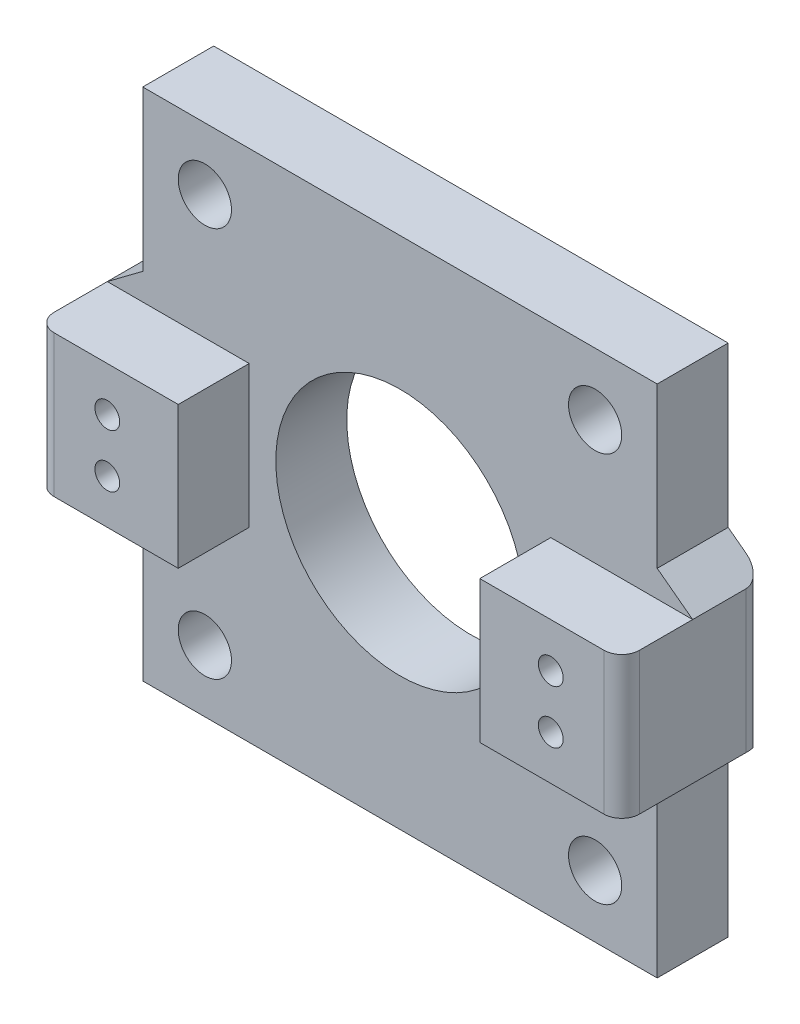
ISO-10303-21;
HEADER;
FILE_DESCRIPTION(('STEP AP214'),'2;1');
FILE_NAME('part.step','',(''),(''),'','','');
FILE_SCHEMA(('AUTOMOTIVE_DESIGN { 1 0 10303 214 1 1 1 1 }'));
ENDSEC;
DATA;
#1=APPLICATION_CONTEXT('core data for automotive mechanical design processes');
#2=APPLICATION_PROTOCOL_DEFINITION('international standard','automotive_design',2000,#1);
#3=PRODUCT_CONTEXT('',#1,'mechanical');
#4=PRODUCT('Part','Part','',(#3));
#5=PRODUCT_RELATED_PRODUCT_CATEGORY('part','',(#4));
#6=PRODUCT_DEFINITION_FORMATION('','',#4);
#7=PRODUCT_DEFINITION_CONTEXT('part definition',#1,'design');
#8=PRODUCT_DEFINITION('design','',#6,#7);
#9=PRODUCT_DEFINITION_SHAPE('','',#8);
#10=(LENGTH_UNIT() NAMED_UNIT(*) SI_UNIT(.MILLI.,.METRE.));
#11=(NAMED_UNIT(*) PLANE_ANGLE_UNIT() SI_UNIT($,.RADIAN.));
#12=(NAMED_UNIT(*) SI_UNIT($,.STERADIAN.) SOLID_ANGLE_UNIT());
#13=UNCERTAINTY_MEASURE_WITH_UNIT(LENGTH_MEASURE(1.E-05),#10,'distance_accuracy_value','');
#14=(GEOMETRIC_REPRESENTATION_CONTEXT(3) GLOBAL_UNCERTAINTY_ASSIGNED_CONTEXT((#13)) GLOBAL_UNIT_ASSIGNED_CONTEXT((#10,
#11,#12)) REPRESENTATION_CONTEXT('',''));
#15=CARTESIAN_POINT('',(0.,0.,0.));
#16=DIRECTION('',(0.,0.,1.));
#17=DIRECTION('',(1.,0.,0.));
#18=AXIS2_PLACEMENT_3D('',#15,#16,#17);
#19=CARTESIAN_POINT('',(6.87683823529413,0.,4.));
#20=DIRECTION('',(1.,0.,0.));
#21=DIRECTION('',(0.,1.,0.));
#22=AXIS2_PLACEMENT_3D('',#19,#20,#21);
#23=PLANE('',#22);
#24=DIRECTION('',(0.,-1.,0.));
#25=VECTOR('',#24,1.);
#26=CARTESIAN_POINT('',(6.87683823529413,0.,0.));
#27=LINE('',#26,#25);
#28=CARTESIAN_POINT('',(6.87683823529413,-10.7242647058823,0.));
#29=VERTEX_POINT('',#28);
#30=CARTESIAN_POINT('',(6.87683823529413,-19.7242647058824,0.));
#31=VERTEX_POINT('',#30);
#32=EDGE_CURVE('E331',#29,#31,#27,.T.);
#33=ORIENTED_EDGE('',*,*,#32,.F.);
#34=DIRECTION('',(0.,0.,1.));
#35=VECTOR('',#34,1.);
#36=CARTESIAN_POINT('',(6.87683823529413,-10.7242647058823,-2.5));
#37=LINE('',#36,#35);
#38=CARTESIAN_POINT('',(6.87683823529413,-10.7242647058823,4.));
#39=VERTEX_POINT('',#38);
#40=EDGE_CURVE('E850',#29,#39,#37,.T.);
#41=ORIENTED_EDGE('',*,*,#40,.T.);
#42=DIRECTION('',(0.,-1.,0.));
#43=VECTOR('',#42,1.);
#44=CARTESIAN_POINT('',(6.87683823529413,0.,4.));
#45=LINE('',#44,#43);
#46=CARTESIAN_POINT('',(6.87683823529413,-19.7242647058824,4.));
#47=VERTEX_POINT('',#46);
#48=EDGE_CURVE('E309',#39,#47,#45,.T.);
#49=ORIENTED_EDGE('',*,*,#48,.T.);
#50=DIRECTION('',(0.,0.,-1.));
#51=VECTOR('',#50,1.);
#52=CARTESIAN_POINT('',(6.87683823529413,-19.7242647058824,4.));
#53=LINE('',#52,#51);
#54=EDGE_CURVE('E327',#47,#31,#53,.T.);
#55=ORIENTED_EDGE('',*,*,#54,.T.);
#56=EDGE_LOOP('',(#33,#41,#49,#55));
#57=FACE_BOUND('',#56,.T.);
#58=ADVANCED_FACE('F37',(#57),#23,.T.);
#59=CARTESIAN_POINT('',(4.87683823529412,-3.72426470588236,-11.3137084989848));
#60=DIRECTION('',(0.,0.,1.));
#61=DIRECTION('',(1.,0.,0.));
#62=AXIS2_PLACEMENT_3D('',#59,#60,#61);
#63=CYLINDRICAL_SURFACE('',#62,0.699999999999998);
#64=CARTESIAN_POINT('',(4.87683823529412,-3.72426470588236,8.));
#65=DIRECTION('',(0.,0.,-1.));
#66=DIRECTION('',(-1.,0.,0.));
#67=AXIS2_PLACEMENT_3D('',#64,#65,#66);
#68=CIRCLE('',#67,0.699999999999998);
#69=CARTESIAN_POINT('',(5.57683823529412,-3.72426470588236,8.));
#70=VERTEX_POINT('',#69);
#71=EDGE_CURVE('E494',#70,#70,#68,.T.);
#72=CARTESIAN_POINT('',(4.87683823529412,-3.72426470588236,1.3));
#73=DIRECTION('',(0.,0.,1.));
#74=DIRECTION('',(1.,0.,0.));
#75=AXIS2_PLACEMENT_3D('',#72,#73,#74);
#76=CIRCLE('',#75,0.699999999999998);
#77=CARTESIAN_POINT('',(5.57683823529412,-3.72426470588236,1.3));
#78=VERTEX_POINT('',#77);
#79=EDGE_CURVE('E474',#78,#78,#76,.F.);
#80=CARTESIAN_POINT('',(5.57683823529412,-3.72426470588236,8.));
#81=CARTESIAN_POINT('',(5.57683823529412,-3.72426470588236,7.93020833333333));
#82=CARTESIAN_POINT('',(5.57683823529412,-3.72426470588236,7.86041666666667));
#83=CARTESIAN_POINT('',(5.57683823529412,-3.72426470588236,7.72083333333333));
#84=CARTESIAN_POINT('',(5.57683823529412,-3.72426470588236,7.65104166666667));
#85=CARTESIAN_POINT('',(5.57683823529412,-3.72426470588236,7.51145833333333));
#86=CARTESIAN_POINT('',(5.57683823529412,-3.72426470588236,7.44166666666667));
#87=CARTESIAN_POINT('',(5.57683823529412,-3.72426470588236,7.30208333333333));
#88=CARTESIAN_POINT('',(5.57683823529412,-3.72426470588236,7.23229166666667));
#89=CARTESIAN_POINT('',(5.57683823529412,-3.72426470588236,7.09270833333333));
#90=CARTESIAN_POINT('',(5.57683823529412,-3.72426470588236,7.02291666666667));
#91=CARTESIAN_POINT('',(5.57683823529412,-3.72426470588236,6.88333333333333));
#92=CARTESIAN_POINT('',(5.57683823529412,-3.72426470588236,6.81354166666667));
#93=CARTESIAN_POINT('',(5.57683823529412,-3.72426470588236,6.67395833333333));
#94=CARTESIAN_POINT('',(5.57683823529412,-3.72426470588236,6.60416666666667));
#95=CARTESIAN_POINT('',(5.57683823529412,-3.72426470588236,6.46458333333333));
#96=CARTESIAN_POINT('',(5.57683823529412,-3.72426470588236,6.39479166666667));
#97=CARTESIAN_POINT('',(5.57683823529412,-3.72426470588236,6.25520833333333));
#98=CARTESIAN_POINT('',(5.57683823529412,-3.72426470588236,6.18541666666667));
#99=CARTESIAN_POINT('',(5.57683823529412,-3.72426470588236,6.04583333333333));
#100=CARTESIAN_POINT('',(5.57683823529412,-3.72426470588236,5.97604166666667));
#101=CARTESIAN_POINT('',(5.57683823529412,-3.72426470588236,5.83645833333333));
#102=CARTESIAN_POINT('',(5.57683823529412,-3.72426470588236,5.76666666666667));
#103=CARTESIAN_POINT('',(5.57683823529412,-3.72426470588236,5.62708333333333));
#104=CARTESIAN_POINT('',(5.57683823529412,-3.72426470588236,5.55729166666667));
#105=CARTESIAN_POINT('',(5.57683823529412,-3.72426470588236,5.41770833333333));
#106=CARTESIAN_POINT('',(5.57683823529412,-3.72426470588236,5.34791666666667));
#107=CARTESIAN_POINT('',(5.57683823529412,-3.72426470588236,5.20833333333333));
#108=CARTESIAN_POINT('',(5.57683823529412,-3.72426470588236,5.13854166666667));
#109=CARTESIAN_POINT('',(5.57683823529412,-3.72426470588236,4.99895833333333));
#110=CARTESIAN_POINT('',(5.57683823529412,-3.72426470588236,4.92916666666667));
#111=CARTESIAN_POINT('',(5.57683823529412,-3.72426470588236,4.78958333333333));
#112=CARTESIAN_POINT('',(5.57683823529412,-3.72426470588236,4.71979166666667));
#113=CARTESIAN_POINT('',(5.57683823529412,-3.72426470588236,4.58020833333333));
#114=CARTESIAN_POINT('',(5.57683823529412,-3.72426470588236,4.51041666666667));
#115=CARTESIAN_POINT('',(5.57683823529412,-3.72426470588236,4.37083333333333));
#116=CARTESIAN_POINT('',(5.57683823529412,-3.72426470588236,4.30104166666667));
#117=CARTESIAN_POINT('',(5.57683823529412,-3.72426470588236,4.16145833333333));
#118=CARTESIAN_POINT('',(5.57683823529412,-3.72426470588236,4.09166666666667));
#119=CARTESIAN_POINT('',(5.57683823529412,-3.72426470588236,3.95208333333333));
#120=CARTESIAN_POINT('',(5.57683823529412,-3.72426470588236,3.88229166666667));
#121=CARTESIAN_POINT('',(5.57683823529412,-3.72426470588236,3.74270833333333));
#122=CARTESIAN_POINT('',(5.57683823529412,-3.72426470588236,3.67291666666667));
#123=CARTESIAN_POINT('',(5.57683823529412,-3.72426470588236,3.53333333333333));
#124=CARTESIAN_POINT('',(5.57683823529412,-3.72426470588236,3.46354166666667));
#125=CARTESIAN_POINT('',(5.57683823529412,-3.72426470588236,3.32395833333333));
#126=CARTESIAN_POINT('',(5.57683823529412,-3.72426470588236,3.25416666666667));
#127=CARTESIAN_POINT('',(5.57683823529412,-3.72426470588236,3.11458333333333));
#128=CARTESIAN_POINT('',(5.57683823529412,-3.72426470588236,3.04479166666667));
#129=CARTESIAN_POINT('',(5.57683823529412,-3.72426470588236,2.90520833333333));
#130=CARTESIAN_POINT('',(5.57683823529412,-3.72426470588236,2.83541666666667));
#131=CARTESIAN_POINT('',(5.57683823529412,-3.72426470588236,2.69583333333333));
#132=CARTESIAN_POINT('',(5.57683823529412,-3.72426470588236,2.62604166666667));
#133=CARTESIAN_POINT('',(5.57683823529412,-3.72426470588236,2.48645833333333));
#134=CARTESIAN_POINT('',(5.57683823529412,-3.72426470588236,2.41666666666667));
#135=CARTESIAN_POINT('',(5.57683823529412,-3.72426470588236,2.27708333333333));
#136=CARTESIAN_POINT('',(5.57683823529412,-3.72426470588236,2.20729166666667));
#137=CARTESIAN_POINT('',(5.57683823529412,-3.72426470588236,2.06770833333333));
#138=CARTESIAN_POINT('',(5.57683823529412,-3.72426470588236,1.99791666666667));
#139=CARTESIAN_POINT('',(5.57683823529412,-3.72426470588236,1.85833333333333));
#140=CARTESIAN_POINT('',(5.57683823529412,-3.72426470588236,1.78854166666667));
#141=CARTESIAN_POINT('',(5.57683823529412,-3.72426470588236,1.64895833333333));
#142=CARTESIAN_POINT('',(5.57683823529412,-3.72426470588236,1.57916666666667));
#143=CARTESIAN_POINT('',(5.57683823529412,-3.72426470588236,1.43958333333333));
#144=CARTESIAN_POINT('',(5.57683823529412,-3.72426470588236,1.36979166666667));
#145=CARTESIAN_POINT('',(5.57683823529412,-3.72426470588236,1.3));
#146=B_SPLINE_CURVE_WITH_KNOTS('',3,(#80,#81,#82,#83,#84,#85,#86,#87,#88,#89,#90,#91,#92,#93,
#94,#95,#96,#97,#98,#99,#100,#101,#102,#103,#104,#105,#106,#107,#108,#109,#110,#111,#112,#113,
#114,#115,#116,#117,#118,#119,#120,#121,#122,#123,#124,#125,#126,#127,#128,#129,#130,#131,#132,
#133,#134,#135,#136,#137,#138,#139,#140,#141,#142,#143,#144,#145),.UNSPECIFIED.,.F.,.F.,(4,2,2,
2,2,2,2,2,2,2,2,2,2,2,2,2,2,2,2,2,2,2,2,2,2,2,2,2,2,2,2,2,4),(0.,0.209375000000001,
0.418749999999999,0.628125,0.837500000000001,1.046875,1.25625,1.465625,1.675,1.884375,2.09375,
2.303125,2.5125,2.721875,2.93125,3.140625,3.35,3.559375,3.76875,3.978125,4.1875,4.396875,
4.60625,4.815625,5.025,5.234375,5.44375,5.653125,5.8625,6.071875,6.28125,6.490625,6.7),.UNSPECIFIED.);
#147=EDGE_CURVE('BSEAM695',#70,#78,#146,.T.);
#148=ORIENTED_EDGE('',*,*,#71,.F.);
#149=ORIENTED_EDGE('',*,*,#79,.T.);
#150=ORIENTED_EDGE('',*,*,#147,.T.);
#151=ORIENTED_EDGE('',*,*,#147,.F.);
#152=EDGE_LOOP('',(#148,#150,#149,#151));
#153=FACE_BOUND('',#152,.T.);
#154=ADVANCED_FACE('F695',(#153),#63,.F.);
#155=CARTESIAN_POINT('',(4.87683823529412,-6.72426470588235,-11.3137084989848));
#156=DIRECTION('',(0.,0.,1.));
#157=DIRECTION('',(1.,0.,0.));
#158=AXIS2_PLACEMENT_3D('',#155,#156,#157);
#159=CYLINDRICAL_SURFACE('',#158,0.699999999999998);
#160=CARTESIAN_POINT('',(4.87683823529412,-6.72426470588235,8.));
#161=DIRECTION('',(0.,0.,-1.));
#162=DIRECTION('',(-1.,0.,0.));
#163=AXIS2_PLACEMENT_3D('',#160,#161,#162);
#164=CIRCLE('',#163,0.699999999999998);
#165=CARTESIAN_POINT('',(5.57683823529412,-6.72426470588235,8.));
#166=VERTEX_POINT('',#165);
#167=EDGE_CURVE('E456',#166,#166,#164,.T.);
#168=CARTESIAN_POINT('',(4.87683823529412,-6.72426470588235,1.3));
#169=DIRECTION('',(0.,0.,1.));
#170=DIRECTION('',(1.,0.,0.));
#171=AXIS2_PLACEMENT_3D('',#168,#169,#170);
#172=CIRCLE('',#171,0.699999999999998);
#173=CARTESIAN_POINT('',(5.57683823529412,-6.72426470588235,1.3));
#174=VERTEX_POINT('',#173);
#175=EDGE_CURVE('E439',#174,#174,#172,.F.);
#176=CARTESIAN_POINT('',(5.57683823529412,-6.72426470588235,8.));
#177=CARTESIAN_POINT('',(5.57683823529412,-6.72426470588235,7.93020833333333));
#178=CARTESIAN_POINT('',(5.57683823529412,-6.72426470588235,7.86041666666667));
#179=CARTESIAN_POINT('',(5.57683823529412,-6.72426470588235,7.72083333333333));
#180=CARTESIAN_POINT('',(5.57683823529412,-6.72426470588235,7.65104166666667));
#181=CARTESIAN_POINT('',(5.57683823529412,-6.72426470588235,7.51145833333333));
#182=CARTESIAN_POINT('',(5.57683823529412,-6.72426470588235,7.44166666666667));
#183=CARTESIAN_POINT('',(5.57683823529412,-6.72426470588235,7.30208333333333));
#184=CARTESIAN_POINT('',(5.57683823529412,-6.72426470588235,7.23229166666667));
#185=CARTESIAN_POINT('',(5.57683823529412,-6.72426470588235,7.09270833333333));
#186=CARTESIAN_POINT('',(5.57683823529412,-6.72426470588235,7.02291666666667));
#187=CARTESIAN_POINT('',(5.57683823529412,-6.72426470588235,6.88333333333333));
#188=CARTESIAN_POINT('',(5.57683823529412,-6.72426470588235,6.81354166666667));
#189=CARTESIAN_POINT('',(5.57683823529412,-6.72426470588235,6.67395833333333));
#190=CARTESIAN_POINT('',(5.57683823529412,-6.72426470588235,6.60416666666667));
#191=CARTESIAN_POINT('',(5.57683823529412,-6.72426470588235,6.46458333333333));
#192=CARTESIAN_POINT('',(5.57683823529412,-6.72426470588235,6.39479166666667));
#193=CARTESIAN_POINT('',(5.57683823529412,-6.72426470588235,6.25520833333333));
#194=CARTESIAN_POINT('',(5.57683823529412,-6.72426470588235,6.18541666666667));
#195=CARTESIAN_POINT('',(5.57683823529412,-6.72426470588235,6.04583333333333));
#196=CARTESIAN_POINT('',(5.57683823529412,-6.72426470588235,5.97604166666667));
#197=CARTESIAN_POINT('',(5.57683823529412,-6.72426470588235,5.83645833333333));
#198=CARTESIAN_POINT('',(5.57683823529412,-6.72426470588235,5.76666666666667));
#199=CARTESIAN_POINT('',(5.57683823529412,-6.72426470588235,5.62708333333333));
#200=CARTESIAN_POINT('',(5.57683823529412,-6.72426470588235,5.55729166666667));
#201=CARTESIAN_POINT('',(5.57683823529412,-6.72426470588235,5.41770833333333));
#202=CARTESIAN_POINT('',(5.57683823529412,-6.72426470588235,5.34791666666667));
#203=CARTESIAN_POINT('',(5.57683823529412,-6.72426470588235,5.20833333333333));
#204=CARTESIAN_POINT('',(5.57683823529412,-6.72426470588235,5.13854166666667));
#205=CARTESIAN_POINT('',(5.57683823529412,-6.72426470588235,4.99895833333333));
#206=CARTESIAN_POINT('',(5.57683823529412,-6.72426470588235,4.92916666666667));
#207=CARTESIAN_POINT('',(5.57683823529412,-6.72426470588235,4.78958333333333));
#208=CARTESIAN_POINT('',(5.57683823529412,-6.72426470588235,4.71979166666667));
#209=CARTESIAN_POINT('',(5.57683823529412,-6.72426470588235,4.58020833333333));
#210=CARTESIAN_POINT('',(5.57683823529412,-6.72426470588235,4.51041666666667));
#211=CARTESIAN_POINT('',(5.57683823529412,-6.72426470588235,4.37083333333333));
#212=CARTESIAN_POINT('',(5.57683823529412,-6.72426470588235,4.30104166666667));
#213=CARTESIAN_POINT('',(5.57683823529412,-6.72426470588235,4.16145833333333));
#214=CARTESIAN_POINT('',(5.57683823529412,-6.72426470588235,4.09166666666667));
#215=CARTESIAN_POINT('',(5.57683823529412,-6.72426470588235,3.95208333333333));
#216=CARTESIAN_POINT('',(5.57683823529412,-6.72426470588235,3.88229166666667));
#217=CARTESIAN_POINT('',(5.57683823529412,-6.72426470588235,3.74270833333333));
#218=CARTESIAN_POINT('',(5.57683823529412,-6.72426470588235,3.67291666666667));
#219=CARTESIAN_POINT('',(5.57683823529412,-6.72426470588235,3.53333333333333));
#220=CARTESIAN_POINT('',(5.57683823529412,-6.72426470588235,3.46354166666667));
#221=CARTESIAN_POINT('',(5.57683823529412,-6.72426470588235,3.32395833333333));
#222=CARTESIAN_POINT('',(5.57683823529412,-6.72426470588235,3.25416666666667));
#223=CARTESIAN_POINT('',(5.57683823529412,-6.72426470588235,3.11458333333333));
#224=CARTESIAN_POINT('',(5.57683823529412,-6.72426470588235,3.04479166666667));
#225=CARTESIAN_POINT('',(5.57683823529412,-6.72426470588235,2.90520833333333));
#226=CARTESIAN_POINT('',(5.57683823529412,-6.72426470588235,2.83541666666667));
#227=CARTESIAN_POINT('',(5.57683823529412,-6.72426470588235,2.69583333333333));
#228=CARTESIAN_POINT('',(5.57683823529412,-6.72426470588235,2.62604166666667));
#229=CARTESIAN_POINT('',(5.57683823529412,-6.72426470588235,2.48645833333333));
#230=CARTESIAN_POINT('',(5.57683823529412,-6.72426470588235,2.41666666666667));
#231=CARTESIAN_POINT('',(5.57683823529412,-6.72426470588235,2.27708333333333));
#232=CARTESIAN_POINT('',(5.57683823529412,-6.72426470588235,2.20729166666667));
#233=CARTESIAN_POINT('',(5.57683823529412,-6.72426470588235,2.06770833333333));
#234=CARTESIAN_POINT('',(5.57683823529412,-6.72426470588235,1.99791666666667));
#235=CARTESIAN_POINT('',(5.57683823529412,-6.72426470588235,1.85833333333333));
#236=CARTESIAN_POINT('',(5.57683823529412,-6.72426470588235,1.78854166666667));
#237=CARTESIAN_POINT('',(5.57683823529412,-6.72426470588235,1.64895833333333));
#238=CARTESIAN_POINT('',(5.57683823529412,-6.72426470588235,1.57916666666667));
#239=CARTESIAN_POINT('',(5.57683823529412,-6.72426470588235,1.43958333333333));
#240=CARTESIAN_POINT('',(5.57683823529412,-6.72426470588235,1.36979166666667));
#241=CARTESIAN_POINT('',(5.57683823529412,-6.72426470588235,1.3));
#242=B_SPLINE_CURVE_WITH_KNOTS('',3,(#176,#177,#178,#179,#180,#181,#182,#183,#184,#185,#186,
#187,#188,#189,#190,#191,#192,#193,#194,#195,#196,#197,#198,#199,#200,#201,#202,#203,#204,#205,
#206,#207,#208,#209,#210,#211,#212,#213,#214,#215,#216,#217,#218,#219,#220,#221,#222,#223,#224,
#225,#226,#227,#228,#229,#230,#231,#232,#233,#234,#235,#236,#237,#238,#239,#240,#241),
.UNSPECIFIED.,.F.,.F.,(4,2,2,2,2,2,2,2,2,2,2,2,2,2,2,2,2,2,2,2,2,2,2,2,2,2,2,2,2,2,2,2,4),(0.,
0.209375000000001,0.418749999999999,0.628125,0.837500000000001,1.046875,1.25625,1.465625,1.675,
1.884375,2.09375,2.303125,2.5125,2.721875,2.93125,3.140625,3.35,3.559375,3.76875,3.978125,
4.1875,4.396875,4.60625,4.815625,5.025,5.234375,5.44375,5.653125,5.8625,6.071875,6.28125,
6.490625,6.7),.UNSPECIFIED.);
#243=EDGE_CURVE('BSEAM703',#166,#174,#242,.T.);
#244=ORIENTED_EDGE('',*,*,#167,.F.);
#245=ORIENTED_EDGE('',*,*,#175,.T.);
#246=ORIENTED_EDGE('',*,*,#243,.T.);
#247=ORIENTED_EDGE('',*,*,#243,.F.);
#248=EDGE_LOOP('',(#244,#246,#245,#247));
#249=FACE_BOUND('',#248,.T.);
#250=ADVANCED_FACE('F703',(#249),#159,.F.);
#251=DIRECTION('',(0.,0.,1.));
#252=VECTOR('',#251,1.);
#253=CARTESIAN_POINT('',(6.87683823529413,0.275735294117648,-2.5));
#254=LINE('',#253,#252);
#255=CARTESIAN_POINT('',(6.87683823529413,0.275735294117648,0.));
#256=VERTEX_POINT('',#255);
#257=CARTESIAN_POINT('',(6.87683823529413,0.275735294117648,4.));
#258=VERTEX_POINT('',#257);
#259=EDGE_CURVE('E281',#256,#258,#254,.T.);
#260=ORIENTED_EDGE('',*,*,#259,.F.);
#261=CARTESIAN_POINT('',(6.87683823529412,9.27573529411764,0.));
#262=VERTEX_POINT('',#261);
#263=EDGE_CURVE('E328',#262,#256,#27,.T.);
#264=ORIENTED_EDGE('',*,*,#263,.F.);
#265=DIRECTION('',(0.,0.,-1.));
#266=VECTOR('',#265,1.);
#267=CARTESIAN_POINT('',(6.87683823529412,9.27573529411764,4.));
#268=LINE('',#267,#266);
#269=CARTESIAN_POINT('',(6.87683823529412,9.27573529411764,4.));
#270=VERTEX_POINT('',#269);
#271=EDGE_CURVE('E307',#270,#262,#268,.T.);
#272=ORIENTED_EDGE('',*,*,#271,.F.);
#273=EDGE_CURVE('E301',#270,#258,#45,.T.);
#274=ORIENTED_EDGE('',*,*,#273,.T.);
#275=EDGE_LOOP('',(#260,#264,#272,#274));
#276=FACE_BOUND('',#275,.T.);
#277=ADVANCED_FACE('F306',(#276),#23,.T.);
#278=CARTESIAN_POINT('',(-22.1231617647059,0.,4.));
#279=DIRECTION('',(1.,0.,0.));
#280=DIRECTION('',(0.,1.,0.));
#281=AXIS2_PLACEMENT_3D('',#278,#279,#280);
#282=PLANE('',#281);
#283=DIRECTION('',(0.,0.,1.));
#284=VECTOR('',#283,1.);
#285=CARTESIAN_POINT('',(-22.1231617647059,0.275735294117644,-2.5));
#286=LINE('',#285,#284);
#287=CARTESIAN_POINT('',(-22.1231617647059,0.275735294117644,0.));
#288=VERTEX_POINT('',#287);
#289=CARTESIAN_POINT('',(-22.1231617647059,0.275735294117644,4.));
#290=VERTEX_POINT('',#289);
#291=EDGE_CURVE('E523',#288,#290,#286,.T.);
#292=ORIENTED_EDGE('',*,*,#291,.T.);
#293=DIRECTION('',(0.,-1.,0.));
#294=VECTOR('',#293,1.);
#295=CARTESIAN_POINT('',(-22.1231617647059,0.,4.));
#296=LINE('',#295,#294);
#297=CARTESIAN_POINT('',(-22.1231617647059,9.27573529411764,4.));
#298=VERTEX_POINT('',#297);
#299=EDGE_CURVE('E318',#298,#290,#296,.T.);
#300=ORIENTED_EDGE('',*,*,#299,.F.);
#301=DIRECTION('',(0.,0.,-1.));
#302=VECTOR('',#301,1.);
#303=CARTESIAN_POINT('',(-22.1231617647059,9.27573529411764,4.));
#304=LINE('',#303,#302);
#305=CARTESIAN_POINT('',(-22.1231617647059,9.27573529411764,0.));
#306=VERTEX_POINT('',#305);
#307=EDGE_CURVE('E347',#298,#306,#304,.T.);
#308=ORIENTED_EDGE('',*,*,#307,.T.);
#309=DIRECTION('',(0.,-1.,0.));
#310=VECTOR('',#309,1.);
#311=CARTESIAN_POINT('',(-22.1231617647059,0.,0.));
#312=LINE('',#311,#310);
#313=EDGE_CURVE('E335',#306,#288,#312,.T.);
#314=ORIENTED_EDGE('',*,*,#313,.T.);
#315=EDGE_LOOP('',(#292,#300,#308,#314));
#316=FACE_BOUND('',#315,.T.);
#317=ADVANCED_FACE('F662',(#316),#282,.F.);
#318=CARTESIAN_POINT('',(0.,0.,0.));
#319=DIRECTION('',(0.,0.,1.));
#320=DIRECTION('',(1.,0.,0.));
#321=AXIS2_PLACEMENT_3D('',#318,#319,#320);
#322=PLANE('',#321);
#323=DIRECTION('',(0.8,-0.6,0.));
#324=VECTOR('',#323,1.);
#325=CARTESIAN_POINT('',(-7.14963235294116,10.7955882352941,0.));
#326=LINE('',#325,#324);
#327=CARTESIAN_POINT('',(7.87683823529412,-0.474264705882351,0.));
#328=VERTEX_POINT('',#327);
#329=EDGE_CURVE('E288',#256,#328,#326,.T.);
#330=ORIENTED_EDGE('',*,*,#329,.T.);
#331=DIRECTION('',(0.,1.,0.));
#332=VECTOR('',#331,1.);
#333=CARTESIAN_POINT('',(7.87683823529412,0.,0.));
#334=LINE('',#333,#332);
#335=CARTESIAN_POINT('',(7.87683823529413,-9.97426470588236,0.));
#336=VERTEX_POINT('',#335);
#337=EDGE_CURVE('E394',#328,#336,#334,.F.);
#338=ORIENTED_EDGE('',*,*,#337,.T.);
#339=DIRECTION('',(0.8,0.6,0.));
#340=VECTOR('',#339,1.);
#341=CARTESIAN_POINT('',(-2.13433823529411,-17.4826470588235,0.));
#342=LINE('',#341,#340);
#343=EDGE_CURVE('E304',#29,#336,#342,.T.);
#344=ORIENTED_EDGE('',*,*,#343,.F.);
#345=ORIENTED_EDGE('',*,*,#32,.T.);
#346=DIRECTION('',(1.,0.,0.));
#347=VECTOR('',#346,1.);
#348=CARTESIAN_POINT('',(0.,-19.7242647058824,0.));
#349=LINE('',#348,#347);
#350=CARTESIAN_POINT('',(-22.1231617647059,-19.7242647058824,0.));
#351=VERTEX_POINT('',#350);
#352=EDGE_CURVE('E337',#351,#31,#349,.T.);
#353=ORIENTED_EDGE('',*,*,#352,.F.);
#354=CARTESIAN_POINT('',(-22.1231617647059,-10.7242647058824,0.));
#355=VERTEX_POINT('',#354);
#356=EDGE_CURVE('E334',#355,#351,#312,.T.);
#357=ORIENTED_EDGE('',*,*,#356,.F.);
#358=DIRECTION('',(-0.8,0.6,0.));
#359=VECTOR('',#358,1.);
#360=CARTESIAN_POINT('',(-13.1119852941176,-17.4826470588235,0.));
#361=LINE('',#360,#359);
#362=CARTESIAN_POINT('',(-23.1231617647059,-9.97426470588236,0.));
#363=VERTEX_POINT('',#362);
#364=EDGE_CURVE('E515',#355,#363,#361,.T.);
#365=ORIENTED_EDGE('',*,*,#364,.T.);
#366=DIRECTION('',(0.,1.,0.));
#367=VECTOR('',#366,1.);
#368=CARTESIAN_POINT('',(-23.1231617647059,-1.22426470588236,0.));
#369=LINE('',#368,#367);
#370=CARTESIAN_POINT('',(-23.1231617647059,-0.474264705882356,0.));
#371=VERTEX_POINT('',#370);
#372=EDGE_CURVE('E350',#363,#371,#369,.T.);
#373=ORIENTED_EDGE('',*,*,#372,.T.);
#374=DIRECTION('',(-0.8,-0.6,0.));
#375=VECTOR('',#374,1.);
#376=CARTESIAN_POINT('',(-8.09669117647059,10.7955882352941,0.));
#377=LINE('',#376,#375);
#378=EDGE_CURVE('E519',#288,#371,#377,.T.);
#379=ORIENTED_EDGE('',*,*,#378,.F.);
#380=ORIENTED_EDGE('',*,*,#313,.F.);
#381=DIRECTION('',(1.,0.,0.));
#382=VECTOR('',#381,1.);
#383=CARTESIAN_POINT('',(0.,9.27573529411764,0.));
#384=LINE('',#383,#382);
#385=EDGE_CURVE('E330',#306,#262,#384,.T.);
#386=ORIENTED_EDGE('',*,*,#385,.T.);
#387=ORIENTED_EDGE('',*,*,#263,.T.);
#388=EDGE_LOOP('',(#330,#338,#344,#345,#353,#357,#365,#373,#379,#380,#386,#387));
#389=FACE_BOUND('',#388,.T.);
#390=DIRECTION('',(1.,0.,0.));
#391=VECTOR('',#390,1.);
#392=CARTESIAN_POINT('',(-15.2463235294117,-10.9242647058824,0.));
#393=LINE('',#392,#391);
#394=CARTESIAN_POINT('',(3.87683823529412,-10.9242647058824,0.));
#395=VERTEX_POINT('',#394);
#396=CARTESIAN_POINT('',(5.87683823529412,-10.9242647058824,0.));
#397=VERTEX_POINT('',#396);
#398=EDGE_CURVE('E445',#395,#397,#393,.T.);
#399=ORIENTED_EDGE('',*,*,#398,.T.);
#400=DIRECTION('',(0.,-1.,0.));
#401=VECTOR('',#400,1.);
#402=CARTESIAN_POINT('',(5.87683823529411,0.,0.));
#403=LINE('',#402,#401);
#404=CARTESIAN_POINT('',(5.87683823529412,-5.92426470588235,0.));
#405=VERTEX_POINT('',#404);
#406=EDGE_CURVE('E443',#405,#397,#403,.T.);
#407=ORIENTED_EDGE('',*,*,#406,.F.);
#408=DIRECTION('',(1.,0.,0.));
#409=VECTOR('',#408,1.);
#410=CARTESIAN_POINT('',(-15.2463235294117,-5.92426470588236,0.));
#411=LINE('',#410,#409);
#412=CARTESIAN_POINT('',(3.87683823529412,-5.92426470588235,0.));
#413=VERTEX_POINT('',#412);
#414=EDGE_CURVE('E432',#413,#405,#411,.T.);
#415=ORIENTED_EDGE('',*,*,#414,.F.);
#416=DIRECTION('',(0.,-1.,0.));
#417=VECTOR('',#416,1.);
#418=CARTESIAN_POINT('',(3.87683823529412,0.,0.));
#419=LINE('',#418,#417);
#420=EDGE_CURVE('E449',#413,#395,#419,.T.);
#421=ORIENTED_EDGE('',*,*,#420,.T.);
#422=EDGE_LOOP('',(#399,#407,#415,#421));
#423=FACE_BOUND('',#422,.T.);
#424=DIRECTION('',(-1.,0.,0.));
#425=VECTOR('',#424,1.);
#426=CARTESIAN_POINT('',(-15.2463235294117,0.475735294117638,0.));
#427=LINE('',#426,#425);
#428=CARTESIAN_POINT('',(5.87683823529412,0.475735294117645,0.));
#429=VERTEX_POINT('',#428);
#430=CARTESIAN_POINT('',(3.87683823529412,0.475735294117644,0.));
#431=VERTEX_POINT('',#430);
#432=EDGE_CURVE('E425',#429,#431,#427,.T.);
#433=ORIENTED_EDGE('',*,*,#432,.T.);
#434=DIRECTION('',(0.,1.,0.));
#435=VECTOR('',#434,1.);
#436=CARTESIAN_POINT('',(3.87683823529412,0.,0.));
#437=LINE('',#436,#435);
#438=CARTESIAN_POINT('',(3.87683823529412,-4.52426470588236,0.));
#439=VERTEX_POINT('',#438);
#440=EDGE_CURVE('E423',#439,#431,#437,.T.);
#441=ORIENTED_EDGE('',*,*,#440,.F.);
#442=DIRECTION('',(-1.,0.,0.));
#443=VECTOR('',#442,1.);
#444=CARTESIAN_POINT('',(-15.2463235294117,-4.52426470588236,0.));
#445=LINE('',#444,#443);
#446=CARTESIAN_POINT('',(5.87683823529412,-4.52426470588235,0.));
#447=VERTEX_POINT('',#446);
#448=EDGE_CURVE('E467',#447,#439,#445,.T.);
#449=ORIENTED_EDGE('',*,*,#448,.F.);
#450=DIRECTION('',(0.,1.,0.));
#451=VECTOR('',#450,1.);
#452=CARTESIAN_POINT('',(5.87683823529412,0.,0.));
#453=LINE('',#452,#451);
#454=EDGE_CURVE('E480',#447,#429,#453,.T.);
#455=ORIENTED_EDGE('',*,*,#454,.T.);
#456=EDGE_LOOP('',(#433,#441,#449,#455));
#457=FACE_BOUND('',#456,.T.);
#458=DIRECTION('',(0.,1.,0.));
#459=VECTOR('',#458,1.);
#460=CARTESIAN_POINT('',(-19.1231617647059,0.,0.));
#461=LINE('',#460,#459);
#462=CARTESIAN_POINT('',(-19.1231617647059,-4.52426470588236,0.));
#463=VERTEX_POINT('',#462);
#464=CARTESIAN_POINT('',(-19.1231617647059,0.475735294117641,0.));
#465=VERTEX_POINT('',#464);
#466=EDGE_CURVE('E522',#463,#465,#461,.T.);
#467=ORIENTED_EDGE('',*,*,#466,.T.);
#468=DIRECTION('',(1.,0.,0.));
#469=VECTOR('',#468,1.);
#470=CARTESIAN_POINT('',(0.,0.475735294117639,0.));
#471=LINE('',#470,#469);
#472=CARTESIAN_POINT('',(-21.1231617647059,0.475735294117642,0.));
#473=VERTEX_POINT('',#472);
#474=EDGE_CURVE('E566',#473,#465,#471,.T.);
#475=ORIENTED_EDGE('',*,*,#474,.F.);
#476=DIRECTION('',(0.,1.,0.));
#477=VECTOR('',#476,1.);
#478=CARTESIAN_POINT('',(-21.1231617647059,0.,0.));
#479=LINE('',#478,#477);
#480=CARTESIAN_POINT('',(-21.1231617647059,-4.52426470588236,0.));
#481=VERTEX_POINT('',#480);
#482=EDGE_CURVE('E583',#481,#473,#479,.T.);
#483=ORIENTED_EDGE('',*,*,#482,.F.);
#484=DIRECTION('',(1.,0.,0.));
#485=VECTOR('',#484,1.);
#486=CARTESIAN_POINT('',(0.,-4.52426470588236,0.));
#487=LINE('',#486,#485);
#488=EDGE_CURVE('E580',#481,#463,#487,.T.);
#489=ORIENTED_EDGE('',*,*,#488,.T.);
#490=EDGE_LOOP('',(#467,#475,#483,#489));
#491=FACE_BOUND('',#490,.T.);
#492=CARTESIAN_POINT('',(-18.6231617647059,-16.2242647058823,0.));
#493=DIRECTION('',(0.,0.,1.));
#494=DIRECTION('',(1.,0.,0.));
#495=AXIS2_PLACEMENT_3D('',#492,#493,#494);
#496=CIRCLE('',#495,1.5);
#497=CARTESIAN_POINT('',(-17.1231617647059,-16.2242647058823,0.));
#498=VERTEX_POINT('',#497);
#499=EDGE_CURVE('E360',#498,#498,#496,.T.);
#500=ORIENTED_EDGE('',*,*,#499,.T.);
#501=EDGE_LOOP('',(#500));
#502=FACE_BOUND('',#501,.T.);
#503=CARTESIAN_POINT('',(3.37683823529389,-16.2242647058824,0.));
#504=DIRECTION('',(0.,0.,1.));
#505=DIRECTION('',(1.,0.,0.));
#506=AXIS2_PLACEMENT_3D('',#503,#504,#505);
#507=CIRCLE('',#506,1.5);
#508=CARTESIAN_POINT('',(4.87683823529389,-16.2242647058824,0.));
#509=VERTEX_POINT('',#508);
#510=EDGE_CURVE('E357',#509,#509,#507,.T.);
#511=ORIENTED_EDGE('',*,*,#510,.T.);
#512=EDGE_LOOP('',(#511));
#513=FACE_BOUND('',#512,.T.);
#514=CARTESIAN_POINT('',(3.376838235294,5.77573529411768,0.));
#515=DIRECTION('',(0.,0.,1.));
#516=DIRECTION('',(1.,0.,0.));
#517=AXIS2_PLACEMENT_3D('',#514,#515,#516);
#518=CIRCLE('',#517,1.5);
#519=CARTESIAN_POINT('',(4.876838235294,5.77573529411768,0.));
#520=VERTEX_POINT('',#519);
#521=EDGE_CURVE('E354',#520,#520,#518,.T.);
#522=ORIENTED_EDGE('',*,*,#521,.T.);
#523=EDGE_LOOP('',(#522));
#524=FACE_BOUND('',#523,.T.);
#525=CARTESIAN_POINT('',(-18.6231617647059,5.77573529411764,0.));
#526=DIRECTION('',(0.,0.,1.));
#527=DIRECTION('',(1.,0.,0.));
#528=AXIS2_PLACEMENT_3D('',#525,#526,#527);
#529=CIRCLE('',#528,1.5);
#530=CARTESIAN_POINT('',(-17.1231617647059,5.77573529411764,0.));
#531=VERTEX_POINT('',#530);
#532=EDGE_CURVE('E351',#531,#531,#529,.T.);
#533=ORIENTED_EDGE('',*,*,#532,.T.);
#534=EDGE_LOOP('',(#533));
#535=FACE_BOUND('',#534,.T.);
#536=CARTESIAN_POINT('',(-7.62316176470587,-5.22426470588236,0.));
#537=DIRECTION('',(0.,0.,1.));
#538=DIRECTION('',(1.,0.,0.));
#539=AXIS2_PLACEMENT_3D('',#536,#537,#538);
#540=CIRCLE('',#539,7.);
#541=CARTESIAN_POINT('',(-0.623161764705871,-5.22426470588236,0.));
#542=VERTEX_POINT('',#541);
#543=EDGE_CURVE('E313',#542,#542,#540,.T.);
#544=ORIENTED_EDGE('',*,*,#543,.T.);
#545=EDGE_LOOP('',(#544));
#546=FACE_BOUND('',#545,.T.);
#547=DIRECTION('',(0.,-1.,0.));
#548=VECTOR('',#547,1.);
#549=CARTESIAN_POINT('',(-21.1231617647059,0.,0.));
#550=LINE('',#549,#548);
#551=CARTESIAN_POINT('',(-21.1231617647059,-5.92426470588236,0.));
#552=VERTEX_POINT('',#551);
#553=CARTESIAN_POINT('',(-21.1231617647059,-10.9242647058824,0.));
#554=VERTEX_POINT('',#553);
#555=EDGE_CURVE('E542',#552,#554,#550,.T.);
#556=ORIENTED_EDGE('',*,*,#555,.T.);
#557=DIRECTION('',(-1.,0.,0.));
#558=VECTOR('',#557,1.);
#559=CARTESIAN_POINT('',(0.,-10.9242647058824,0.));
#560=LINE('',#559,#558);
#561=CARTESIAN_POINT('',(-19.1231617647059,-10.9242647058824,0.));
#562=VERTEX_POINT('',#561);
#563=EDGE_CURVE('E530',#562,#554,#560,.T.);
#564=ORIENTED_EDGE('',*,*,#563,.F.);
#565=DIRECTION('',(0.,-1.,0.));
#566=VECTOR('',#565,1.);
#567=CARTESIAN_POINT('',(-19.1231617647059,0.,0.));
#568=LINE('',#567,#566);
#569=CARTESIAN_POINT('',(-19.1231617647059,-5.92426470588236,0.));
#570=VERTEX_POINT('',#569);
#571=EDGE_CURVE('E549',#570,#562,#568,.T.);
#572=ORIENTED_EDGE('',*,*,#571,.F.);
#573=DIRECTION('',(-1.,0.,0.));
#574=VECTOR('',#573,1.);
#575=CARTESIAN_POINT('',(0.,-5.92426470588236,0.));
#576=LINE('',#575,#574);
#577=EDGE_CURVE('E545',#570,#552,#576,.T.);
#578=ORIENTED_EDGE('',*,*,#577,.T.);
#579=EDGE_LOOP('',(#556,#564,#572,#578));
#580=FACE_BOUND('',#579,.T.);
#581=ADVANCED_FACE('F421',(#389,#423,#457,#491,#502,#513,#524,#535,#546,#580),#322,.F.);
#582=CARTESIAN_POINT('',(-20.1231617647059,-3.72426470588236,-11.3137084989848));
#583=DIRECTION('',(0.,0.,1.));
#584=DIRECTION('',(1.,0.,0.));
#585=AXIS2_PLACEMENT_3D('',#582,#583,#584);
#586=CYLINDRICAL_SURFACE('',#585,0.699999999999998);
#587=CARTESIAN_POINT('',(-20.1231617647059,-3.72426470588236,8.));
#588=DIRECTION('',(0.,0.,1.));
#589=DIRECTION('',(1.,0.,0.));
#590=AXIS2_PLACEMENT_3D('',#587,#588,#589);
#591=CIRCLE('',#590,0.699999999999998);
#592=CARTESIAN_POINT('',(-19.4231617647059,-3.72426470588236,8.));
#593=VERTEX_POINT('',#592);
#594=EDGE_CURVE('E597',#593,#593,#591,.T.);
#595=ORIENTED_EDGE('',*,*,#594,.T.);
#596=EDGE_LOOP('',(#595));
#597=FACE_BOUND('',#596,.T.);
#598=CARTESIAN_POINT('',(-20.1231617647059,-3.72426470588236,1.3));
#599=DIRECTION('',(0.,0.,-1.));
#600=DIRECTION('',(-1.,0.,0.));
#601=AXIS2_PLACEMENT_3D('',#598,#599,#600);
#602=CIRCLE('',#601,0.699999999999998);
#603=CARTESIAN_POINT('',(-20.8231617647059,-3.72426470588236,1.3));
#604=VERTEX_POINT('',#603);
#605=EDGE_CURVE('E574',#604,#604,#602,.F.);
#606=ORIENTED_EDGE('',*,*,#605,.F.);
#607=EDGE_LOOP('',(#606));
#608=FACE_BOUND('',#607,.T.);
#609=ADVANCED_FACE('F661',(#597,#608),#586,.F.);
#610=CARTESIAN_POINT('',(-20.1231617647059,-6.72426470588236,-11.3137084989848));
#611=DIRECTION('',(0.,0.,1.));
#612=DIRECTION('',(1.,0.,0.));
#613=AXIS2_PLACEMENT_3D('',#610,#611,#612);
#614=CYLINDRICAL_SURFACE('',#613,0.699999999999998);
#615=CARTESIAN_POINT('',(-20.1231617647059,-6.72426470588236,8.));
#616=DIRECTION('',(0.,0.,1.));
#617=DIRECTION('',(1.,0.,0.));
#618=AXIS2_PLACEMENT_3D('',#615,#616,#617);
#619=CIRCLE('',#618,0.699999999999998);
#620=CARTESIAN_POINT('',(-19.4231617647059,-6.72426470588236,8.));
#621=VERTEX_POINT('',#620);
#622=EDGE_CURVE('E556',#621,#621,#619,.T.);
#623=ORIENTED_EDGE('',*,*,#622,.T.);
#624=EDGE_LOOP('',(#623));
#625=FACE_BOUND('',#624,.T.);
#626=CARTESIAN_POINT('',(-20.1231617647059,-6.72426470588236,1.3));
#627=DIRECTION('',(0.,0.,-1.));
#628=DIRECTION('',(-1.,0.,0.));
#629=AXIS2_PLACEMENT_3D('',#626,#627,#628);
#630=CIRCLE('',#629,0.699999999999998);
#631=CARTESIAN_POINT('',(-20.8231617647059,-6.72426470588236,1.3));
#632=VERTEX_POINT('',#631);
#633=EDGE_CURVE('E538',#632,#632,#630,.F.);
#634=ORIENTED_EDGE('',*,*,#633,.F.);
#635=EDGE_LOOP('',(#634));
#636=FACE_BOUND('',#635,.T.);
#637=ADVANCED_FACE('F767',(#625,#636),#614,.F.);
#638=CARTESIAN_POINT('',(0.,9.27573529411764,4.));
#639=DIRECTION('',(0.,1.,0.));
#640=DIRECTION('',(0.,0.,1.));
#641=AXIS2_PLACEMENT_3D('',#638,#639,#640);
#642=PLANE('',#641);
#643=ORIENTED_EDGE('',*,*,#385,.F.);
#644=ORIENTED_EDGE('',*,*,#307,.F.);
#645=DIRECTION('',(1.,0.,0.));
#646=VECTOR('',#645,1.);
#647=CARTESIAN_POINT('',(0.,9.27573529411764,4.));
#648=LINE('',#647,#646);
#649=EDGE_CURVE('E308',#298,#270,#648,.T.);
#650=ORIENTED_EDGE('',*,*,#649,.T.);
#651=ORIENTED_EDGE('',*,*,#271,.T.);
#652=EDGE_LOOP('',(#643,#644,#650,#651));
#653=FACE_BOUND('',#652,.T.);
#654=ADVANCED_FACE('F770',(#653),#642,.T.);
#655=CARTESIAN_POINT('',(-22.1231617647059,-10.7242647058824,4.));
#656=VERTEX_POINT('',#655);
#657=CARTESIAN_POINT('',(-22.1231617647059,-19.7242647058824,4.));
#658=VERTEX_POINT('',#657);
#659=EDGE_CURVE('E311',#656,#658,#296,.T.);
#660=ORIENTED_EDGE('',*,*,#659,.F.);
#661=DIRECTION('',(0.,0.,1.));
#662=VECTOR('',#661,1.);
#663=CARTESIAN_POINT('',(-22.1231617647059,-10.7242647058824,-2.5));
#664=LINE('',#663,#662);
#665=EDGE_CURVE('E513',#355,#656,#664,.T.);
#666=ORIENTED_EDGE('',*,*,#665,.F.);
#667=ORIENTED_EDGE('',*,*,#356,.T.);
#668=DIRECTION('',(0.,0.,-1.));
#669=VECTOR('',#668,1.);
#670=CARTESIAN_POINT('',(-22.1231617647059,-19.7242647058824,4.));
#671=LINE('',#670,#669);
#672=EDGE_CURVE('E344',#658,#351,#671,.T.);
#673=ORIENTED_EDGE('',*,*,#672,.F.);
#674=EDGE_LOOP('',(#660,#666,#667,#673));
#675=FACE_BOUND('',#674,.T.);
#676=ADVANCED_FACE('F716',(#675),#282,.F.);
#677=CARTESIAN_POINT('',(0.,-19.7242647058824,4.));
#678=DIRECTION('',(0.,1.,0.));
#679=DIRECTION('',(0.,0.,1.));
#680=AXIS2_PLACEMENT_3D('',#677,#678,#679);
#681=PLANE('',#680);
#682=ORIENTED_EDGE('',*,*,#352,.T.);
#683=ORIENTED_EDGE('',*,*,#54,.F.);
#684=DIRECTION('',(1.,0.,0.));
#685=VECTOR('',#684,1.);
#686=CARTESIAN_POINT('',(0.,-19.7242647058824,4.));
#687=LINE('',#686,#685);
#688=EDGE_CURVE('E321',#658,#47,#687,.T.);
#689=ORIENTED_EDGE('',*,*,#688,.F.);
#690=ORIENTED_EDGE('',*,*,#672,.T.);
#691=EDGE_LOOP('',(#682,#683,#689,#690));
#692=FACE_BOUND('',#691,.T.);
#693=ADVANCED_FACE('F655',(#692),#681,.F.);
#694=CARTESIAN_POINT('',(-7.62316176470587,-5.22426470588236,4.));
#695=DIRECTION('',(0.,0.,-1.));
#696=DIRECTION('',(-1.,0.,0.));
#697=AXIS2_PLACEMENT_3D('',#694,#695,#696);
#698=CYLINDRICAL_SURFACE('',#697,7.);
#699=CARTESIAN_POINT('',(-7.62316176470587,-5.22426470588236,4.));
#700=DIRECTION('',(0.,0.,1.));
#701=DIRECTION('',(1.,0.,0.));
#702=AXIS2_PLACEMENT_3D('',#699,#700,#701);
#703=CIRCLE('',#702,7.);
#704=CARTESIAN_POINT('',(-0.623161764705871,-5.22426470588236,4.));
#705=VERTEX_POINT('',#704);
#706=EDGE_CURVE('E324',#705,#705,#703,.T.);
#707=ORIENTED_EDGE('',*,*,#706,.T.);
#708=EDGE_LOOP('',(#707));
#709=FACE_BOUND('',#708,.T.);
#710=ORIENTED_EDGE('',*,*,#543,.F.);
#711=EDGE_LOOP('',(#710));
#712=FACE_BOUND('',#711,.T.);
#713=ADVANCED_FACE('F642',(#709,#712),#698,.F.);
#714=CARTESIAN_POINT('',(0.,0.,4.));
#715=DIRECTION('',(0.,0.,1.));
#716=DIRECTION('',(1.,0.,0.));
#717=AXIS2_PLACEMENT_3D('',#714,#715,#716);
#718=PLANE('',#717);
#719=DIRECTION('',(0.,1.,0.));
#720=VECTOR('',#719,1.);
#721=CARTESIAN_POINT('',(0.876838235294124,0.,4.));
#722=LINE('',#721,#720);
#723=CARTESIAN_POINT('',(0.876838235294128,-9.22426470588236,4.));
#724=VERTEX_POINT('',#723);
#725=CARTESIAN_POINT('',(0.876838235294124,-1.22426470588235,4.));
#726=VERTEX_POINT('',#725);
#727=EDGE_CURVE('E383',#724,#726,#722,.T.);
#728=ORIENTED_EDGE('',*,*,#727,.T.);
#729=DIRECTION('',(1.,0.,0.));
#730=VECTOR('',#729,1.);
#731=CARTESIAN_POINT('',(0.,-1.22426470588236,4.));
#732=LINE('',#731,#730);
#733=CARTESIAN_POINT('',(8.87683823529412,-1.22426470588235,4.));
#734=VERTEX_POINT('',#733);
#735=EDGE_CURVE('E303',#726,#734,#732,.T.);
#736=ORIENTED_EDGE('',*,*,#735,.T.);
#737=DIRECTION('',(-0.8,0.6,0.));
#738=VECTOR('',#737,1.);
#739=CARTESIAN_POINT('',(-7.14963235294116,10.7955882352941,4.));
#740=LINE('',#739,#738);
#741=EDGE_CURVE('E285',#734,#258,#740,.T.);
#742=ORIENTED_EDGE('',*,*,#741,.T.);
#743=ORIENTED_EDGE('',*,*,#273,.F.);
#744=ORIENTED_EDGE('',*,*,#649,.F.);
#745=ORIENTED_EDGE('',*,*,#299,.T.);
#746=DIRECTION('',(0.8,0.6,0.));
#747=VECTOR('',#746,1.);
#748=CARTESIAN_POINT('',(-8.09669117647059,10.7955882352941,4.));
#749=LINE('',#748,#747);
#750=CARTESIAN_POINT('',(-24.1231617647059,-1.22426470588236,4.));
#751=VERTEX_POINT('',#750);
#752=EDGE_CURVE('E518',#751,#290,#749,.T.);
#753=ORIENTED_EDGE('',*,*,#752,.F.);
#754=DIRECTION('',(-1.,0.,0.));
#755=VECTOR('',#754,1.);
#756=CARTESIAN_POINT('',(0.,-1.22426470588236,4.));
#757=LINE('',#756,#755);
#758=CARTESIAN_POINT('',(-16.1231617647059,-1.22426470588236,4.));
#759=VERTEX_POINT('',#758);
#760=EDGE_CURVE('E625',#759,#751,#757,.T.);
#761=ORIENTED_EDGE('',*,*,#760,.F.);
#762=DIRECTION('',(0.,1.,0.));
#763=VECTOR('',#762,1.);
#764=CARTESIAN_POINT('',(-16.1231617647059,0.,4.));
#765=LINE('',#764,#763);
#766=CARTESIAN_POINT('',(-16.1231617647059,-9.22426470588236,4.));
#767=VERTEX_POINT('',#766);
#768=EDGE_CURVE('E612',#767,#759,#765,.T.);
#769=ORIENTED_EDGE('',*,*,#768,.F.);
#770=DIRECTION('',(1.,0.,0.));
#771=VECTOR('',#770,1.);
#772=CARTESIAN_POINT('',(0.,-9.22426470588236,4.));
#773=LINE('',#772,#771);
#774=CARTESIAN_POINT('',(-24.1231617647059,-9.22426470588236,4.));
#775=VERTEX_POINT('',#774);
#776=EDGE_CURVE('E622',#775,#767,#773,.T.);
#777=ORIENTED_EDGE('',*,*,#776,.F.);
#778=DIRECTION('',(0.8,-0.6,0.));
#779=VECTOR('',#778,1.);
#780=CARTESIAN_POINT('',(-13.1119852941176,-17.4826470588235,4.));
#781=LINE('',#780,#779);
#782=EDGE_CURVE('E416',#775,#656,#781,.T.);
#783=ORIENTED_EDGE('',*,*,#782,.T.);
#784=ORIENTED_EDGE('',*,*,#659,.T.);
#785=ORIENTED_EDGE('',*,*,#688,.T.);
#786=ORIENTED_EDGE('',*,*,#48,.F.);
#787=DIRECTION('',(-0.8,-0.6,0.));
#788=VECTOR('',#787,1.);
#789=CARTESIAN_POINT('',(-2.13433823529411,-17.4826470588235,4.));
#790=LINE('',#789,#788);
#791=CARTESIAN_POINT('',(8.87683823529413,-9.22426470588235,4.));
#792=VERTEX_POINT('',#791);
#793=EDGE_CURVE('E849',#792,#39,#790,.T.);
#794=ORIENTED_EDGE('',*,*,#793,.F.);
#795=DIRECTION('',(-1.,0.,0.));
#796=VECTOR('',#795,1.);
#797=CARTESIAN_POINT('',(0.,-9.22426470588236,4.));
#798=LINE('',#797,#796);
#799=EDGE_CURVE('E380',#792,#724,#798,.T.);
#800=ORIENTED_EDGE('',*,*,#799,.T.);
#801=EDGE_LOOP('',(#728,#736,#742,#743,#744,#745,#753,#761,#769,#777,#783,#784,#785,#786,#794,#800));
#802=FACE_BOUND('',#801,.T.);
#803=CARTESIAN_POINT('',(-18.6231617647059,-16.2242647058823,4.));
#804=DIRECTION('',(0.,0.,1.));
#805=DIRECTION('',(1.,0.,0.));
#806=AXIS2_PLACEMENT_3D('',#803,#804,#805);
#807=CIRCLE('',#806,1.5);
#808=CARTESIAN_POINT('',(-17.1231617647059,-16.2242647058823,4.));
#809=VERTEX_POINT('',#808);
#810=EDGE_CURVE('E628',#809,#809,#807,.T.);
#811=ORIENTED_EDGE('',*,*,#810,.F.);
#812=EDGE_LOOP('',(#811));
#813=FACE_BOUND('',#812,.T.);
#814=CARTESIAN_POINT('',(3.37683823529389,-16.2242647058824,4.));
#815=DIRECTION('',(0.,0.,1.));
#816=DIRECTION('',(1.,0.,0.));
#817=AXIS2_PLACEMENT_3D('',#814,#815,#816);
#818=CIRCLE('',#817,1.5);
#819=CARTESIAN_POINT('',(4.87683823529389,-16.2242647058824,4.));
#820=VERTEX_POINT('',#819);
#821=EDGE_CURVE('E632',#820,#820,#818,.T.);
#822=ORIENTED_EDGE('',*,*,#821,.F.);
#823=EDGE_LOOP('',(#822));
#824=FACE_BOUND('',#823,.T.);
#825=CARTESIAN_POINT('',(3.376838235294,5.77573529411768,4.));
#826=DIRECTION('',(0.,0.,1.));
#827=DIRECTION('',(1.,0.,0.));
#828=AXIS2_PLACEMENT_3D('',#825,#826,#827);
#829=CIRCLE('',#828,1.5);
#830=CARTESIAN_POINT('',(4.876838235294,5.77573529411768,4.));
#831=VERTEX_POINT('',#830);
#832=EDGE_CURVE('E629',#831,#831,#829,.T.);
#833=ORIENTED_EDGE('',*,*,#832,.F.);
#834=EDGE_LOOP('',(#833));
#835=FACE_BOUND('',#834,.T.);
#836=CARTESIAN_POINT('',(-18.6231617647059,5.77573529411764,4.));
#837=DIRECTION('',(0.,0.,1.));
#838=DIRECTION('',(1.,0.,0.));
#839=AXIS2_PLACEMENT_3D('',#836,#837,#838);
#840=CIRCLE('',#839,1.5);
#841=CARTESIAN_POINT('',(-17.1231617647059,5.77573529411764,4.));
#842=VERTEX_POINT('',#841);
#843=EDGE_CURVE('E315',#842,#842,#840,.T.);
#844=ORIENTED_EDGE('',*,*,#843,.F.);
#845=EDGE_LOOP('',(#844));
#846=FACE_BOUND('',#845,.T.);
#847=ORIENTED_EDGE('',*,*,#706,.F.);
#848=EDGE_LOOP('',(#847));
#849=FACE_BOUND('',#848,.T.);
#850=ADVANCED_FACE('F298',(#802,#813,#824,#835,#846,#849),#718,.T.);
#851=CARTESIAN_POINT('',(-18.6231617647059,5.77573529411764,-1.));
#852=DIRECTION('',(0.,0.,1.));
#853=DIRECTION('',(1.,0.,0.));
#854=AXIS2_PLACEMENT_3D('',#851,#852,#853);
#855=CYLINDRICAL_SURFACE('',#854,1.5);
#856=ORIENTED_EDGE('',*,*,#843,.T.);
#857=EDGE_LOOP('',(#856));
#858=FACE_BOUND('',#857,.T.);
#859=ORIENTED_EDGE('',*,*,#532,.F.);
#860=EDGE_LOOP('',(#859));
#861=FACE_BOUND('',#860,.T.);
#862=ADVANCED_FACE('F641',(#858,#861),#855,.F.);
#863=CARTESIAN_POINT('',(3.376838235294,5.77573529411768,-1.));
#864=DIRECTION('',(0.,0.,1.));
#865=DIRECTION('',(1.,0.,0.));
#866=AXIS2_PLACEMENT_3D('',#863,#864,#865);
#867=CYLINDRICAL_SURFACE('',#866,1.5);
#868=ORIENTED_EDGE('',*,*,#832,.T.);
#869=EDGE_LOOP('',(#868));
#870=FACE_BOUND('',#869,.T.);
#871=ORIENTED_EDGE('',*,*,#521,.F.);
#872=EDGE_LOOP('',(#871));
#873=FACE_BOUND('',#872,.T.);
#874=ADVANCED_FACE('F790',(#870,#873),#867,.F.);
#875=CARTESIAN_POINT('',(3.37683823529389,-16.2242647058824,-1.));
#876=DIRECTION('',(0.,0.,1.));
#877=DIRECTION('',(1.,0.,0.));
#878=AXIS2_PLACEMENT_3D('',#875,#876,#877);
#879=CYLINDRICAL_SURFACE('',#878,1.5);
#880=ORIENTED_EDGE('',*,*,#821,.T.);
#881=EDGE_LOOP('',(#880));
#882=FACE_BOUND('',#881,.T.);
#883=ORIENTED_EDGE('',*,*,#510,.F.);
#884=EDGE_LOOP('',(#883));
#885=FACE_BOUND('',#884,.T.);
#886=ADVANCED_FACE('F793',(#882,#885),#879,.F.);
#887=CARTESIAN_POINT('',(-18.6231617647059,-16.2242647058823,-1.));
#888=DIRECTION('',(0.,0.,1.));
#889=DIRECTION('',(1.,0.,0.));
#890=AXIS2_PLACEMENT_3D('',#887,#888,#889);
#891=CYLINDRICAL_SURFACE('',#890,1.5);
#892=ORIENTED_EDGE('',*,*,#810,.T.);
#893=EDGE_LOOP('',(#892));
#894=FACE_BOUND('',#893,.T.);
#895=ORIENTED_EDGE('',*,*,#499,.F.);
#896=EDGE_LOOP('',(#895));
#897=FACE_BOUND('',#896,.T.);
#898=ADVANCED_FACE('F637',(#894,#897),#891,.F.);
#899=CARTESIAN_POINT('',(-24.1231617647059,-1.22426470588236,-11.3137084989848));
#900=DIRECTION('',(0.,1.,0.));
#901=DIRECTION('',(0.,0.,1.));
#902=AXIS2_PLACEMENT_3D('',#899,#900,#901);
#903=PLANE('',#902);
#904=DIRECTION('',(0.,0.,1.));
#905=VECTOR('',#904,1.);
#906=CARTESIAN_POINT('',(-24.1231617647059,-1.22426470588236,-11.3137084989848));
#907=LINE('',#906,#905);
#908=CARTESIAN_POINT('',(-24.1231617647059,-1.22426470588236,7.));
#909=VERTEX_POINT('',#908);
#910=EDGE_CURVE('E618',#751,#909,#907,.T.);
#911=ORIENTED_EDGE('',*,*,#910,.T.);
#912=CARTESIAN_POINT('',(-23.1231617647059,-1.22426470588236,7.));
#913=DIRECTION('',(0.,1.,0.));
#914=DIRECTION('',(0.,0.,1.));
#915=AXIS2_PLACEMENT_3D('',#912,#913,#914);
#916=CIRCLE('',#915,1.);
#917=CARTESIAN_POINT('',(-23.1231617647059,-1.22426470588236,8.));
#918=VERTEX_POINT('',#917);
#919=EDGE_CURVE('E378',#909,#918,#916,.T.);
#920=ORIENTED_EDGE('',*,*,#919,.T.);
#921=DIRECTION('',(-1.,0.,0.));
#922=VECTOR('',#921,1.);
#923=CARTESIAN_POINT('',(-24.1231617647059,-1.22426470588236,8.));
#924=LINE('',#923,#922);
#925=CARTESIAN_POINT('',(-16.1231617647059,-1.22426470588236,8.));
#926=VERTEX_POINT('',#925);
#927=EDGE_CURVE('E603',#926,#918,#924,.T.);
#928=ORIENTED_EDGE('',*,*,#927,.F.);
#929=DIRECTION('',(0.,0.,1.));
#930=VECTOR('',#929,1.);
#931=CARTESIAN_POINT('',(-16.1231617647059,-1.22426470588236,-11.3137084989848));
#932=LINE('',#931,#930);
#933=EDGE_CURVE('E608',#759,#926,#932,.T.);
#934=ORIENTED_EDGE('',*,*,#933,.F.);
#935=ORIENTED_EDGE('',*,*,#760,.T.);
#936=EDGE_LOOP('',(#911,#920,#928,#934,#935));
#937=FACE_BOUND('',#936,.T.);
#938=ADVANCED_FACE('F779',(#937),#903,.T.);
#939=CARTESIAN_POINT('',(-24.1231617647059,-9.22426470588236,-11.3137084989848));
#940=DIRECTION('',(0.,-1.,0.));
#941=DIRECTION('',(0.,0.,-1.));
#942=AXIS2_PLACEMENT_3D('',#939,#940,#941);
#943=PLANE('',#942);
#944=DIRECTION('',(1.,0.,0.));
#945=VECTOR('',#944,1.);
#946=CARTESIAN_POINT('',(-24.1231617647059,-9.22426470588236,8.));
#947=LINE('',#946,#945);
#948=CARTESIAN_POINT('',(-23.1231617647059,-9.22426470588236,8.));
#949=VERTEX_POINT('',#948);
#950=CARTESIAN_POINT('',(-16.1231617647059,-9.22426470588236,8.));
#951=VERTEX_POINT('',#950);
#952=EDGE_CURVE('E606',#949,#951,#947,.T.);
#953=ORIENTED_EDGE('',*,*,#952,.F.);
#954=CARTESIAN_POINT('',(-23.1231617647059,-9.22426470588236,7.));
#955=DIRECTION('',(0.,-1.,0.));
#956=DIRECTION('',(0.,0.,-1.));
#957=AXIS2_PLACEMENT_3D('',#954,#955,#956);
#958=CIRCLE('',#957,1.);
#959=CARTESIAN_POINT('',(-24.1231617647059,-9.22426470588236,7.));
#960=VERTEX_POINT('',#959);
#961=EDGE_CURVE('E376',#949,#960,#958,.T.);
#962=ORIENTED_EDGE('',*,*,#961,.T.);
#963=DIRECTION('',(0.,0.,1.));
#964=VECTOR('',#963,1.);
#965=CARTESIAN_POINT('',(-24.1231617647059,-9.22426470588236,-11.3137084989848));
#966=LINE('',#965,#964);
#967=EDGE_CURVE('E615',#775,#960,#966,.T.);
#968=ORIENTED_EDGE('',*,*,#967,.F.);
#969=ORIENTED_EDGE('',*,*,#776,.T.);
#970=DIRECTION('',(0.,0.,1.));
#971=VECTOR('',#970,1.);
#972=CARTESIAN_POINT('',(-16.1231617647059,-9.22426470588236,-11.3137084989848));
#973=LINE('',#972,#971);
#974=EDGE_CURVE('E609',#767,#951,#973,.T.);
#975=ORIENTED_EDGE('',*,*,#974,.T.);
#976=EDGE_LOOP('',(#953,#962,#968,#969,#975));
#977=FACE_BOUND('',#976,.T.);
#978=ADVANCED_FACE('F775',(#977),#943,.T.);
#979=CARTESIAN_POINT('',(-24.1231617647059,-1.22426470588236,-11.3137084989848));
#980=DIRECTION('',(-1.,0.,0.));
#981=DIRECTION('',(0.,-1.,0.));
#982=AXIS2_PLACEMENT_3D('',#979,#980,#981);
#983=PLANE('',#982);
#984=CARTESIAN_POINT('',(-24.1231617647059,-1.22426470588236,1.));
#985=VERTEX_POINT('',#984);
#986=EDGE_CURVE('E616',#985,#751,#907,.T.);
#987=ORIENTED_EDGE('',*,*,#986,.F.);
#988=DIRECTION('',(0.,1.,0.));
#989=VECTOR('',#988,1.);
#990=CARTESIAN_POINT('',(-24.1231617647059,-9.22426470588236,1.));
#991=LINE('',#990,#989);
#992=CARTESIAN_POINT('',(-24.1231617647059,-9.22426470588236,1.));
#993=VERTEX_POINT('',#992);
#994=EDGE_CURVE('E369',#985,#993,#991,.F.);
#995=ORIENTED_EDGE('',*,*,#994,.T.);
#996=EDGE_CURVE('E613',#993,#775,#966,.T.);
#997=ORIENTED_EDGE('',*,*,#996,.T.);
#998=ORIENTED_EDGE('',*,*,#967,.T.);
#999=DIRECTION('',(0.,-1.,0.));
#1000=VECTOR('',#999,1.);
#1001=CARTESIAN_POINT('',(-24.1231617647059,-1.22426470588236,7.));
#1002=LINE('',#1001,#1000);
#1003=EDGE_CURVE('E367',#960,#909,#1002,.F.);
#1004=ORIENTED_EDGE('',*,*,#1003,.T.);
#1005=ORIENTED_EDGE('',*,*,#910,.F.);
#1006=EDGE_LOOP('',(#987,#995,#997,#998,#1004,#1005));
#1007=FACE_BOUND('',#1006,.T.);
#1008=ADVANCED_FACE('F778',(#1007),#983,.T.);
#1009=CARTESIAN_POINT('',(-16.1231617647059,-1.22426470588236,-11.3137084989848));
#1010=DIRECTION('',(1.,0.,0.));
#1011=DIRECTION('',(0.,0.,-1.));
#1012=AXIS2_PLACEMENT_3D('',#1009,#1010,#1011);
#1013=PLANE('',#1012);
#1014=ORIENTED_EDGE('',*,*,#974,.F.);
#1015=ORIENTED_EDGE('',*,*,#768,.T.);
#1016=ORIENTED_EDGE('',*,*,#933,.T.);
#1017=DIRECTION('',(0.,1.,0.));
#1018=VECTOR('',#1017,1.);
#1019=CARTESIAN_POINT('',(-16.1231617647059,-1.22426470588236,8.));
#1020=LINE('',#1019,#1018);
#1021=EDGE_CURVE('E600',#951,#926,#1020,.T.);
#1022=ORIENTED_EDGE('',*,*,#1021,.F.);
#1023=EDGE_LOOP('',(#1014,#1015,#1016,#1022));
#1024=FACE_BOUND('',#1023,.T.);
#1025=ADVANCED_FACE('F765',(#1024),#1013,.T.);
#1026=CARTESIAN_POINT('',(0.,0.,8.));
#1027=DIRECTION('',(0.,0.,1.));
#1028=DIRECTION('',(1.,0.,0.));
#1029=AXIS2_PLACEMENT_3D('',#1026,#1027,#1028);
#1030=PLANE('',#1029);
#1031=ORIENTED_EDGE('',*,*,#594,.F.);
#1032=EDGE_LOOP('',(#1031));
#1033=FACE_BOUND('',#1032,.T.);
#1034=ORIENTED_EDGE('',*,*,#927,.T.);
#1035=DIRECTION('',(0.,-1.,0.));
#1036=VECTOR('',#1035,1.);
#1037=CARTESIAN_POINT('',(-23.1231617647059,0.,8.));
#1038=LINE('',#1037,#1036);
#1039=EDGE_CURVE('E373',#918,#949,#1038,.T.);
#1040=ORIENTED_EDGE('',*,*,#1039,.T.);
#1041=ORIENTED_EDGE('',*,*,#952,.T.);
#1042=ORIENTED_EDGE('',*,*,#1021,.T.);
#1043=EDGE_LOOP('',(#1034,#1040,#1041,#1042));
#1044=FACE_BOUND('',#1043,.T.);
#1045=ORIENTED_EDGE('',*,*,#622,.F.);
#1046=EDGE_LOOP('',(#1045));
#1047=FACE_BOUND('',#1046,.T.);
#1048=ADVANCED_FACE('F691',(#1033,#1044,#1047),#1030,.T.);
#1049=CARTESIAN_POINT('',(-21.1231617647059,0.,1.3));
#1050=DIRECTION('',(1.,0.,0.));
#1051=DIRECTION('',(0.,1.,0.));
#1052=AXIS2_PLACEMENT_3D('',#1049,#1050,#1051);
#1053=PLANE('',#1052);
#1054=ORIENTED_EDGE('',*,*,#555,.F.);
#1055=DIRECTION('',(0.,0.,-1.));
#1056=VECTOR('',#1055,1.);
#1057=CARTESIAN_POINT('',(-21.1231617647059,-5.92426470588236,1.3));
#1058=LINE('',#1057,#1056);
#1059=CARTESIAN_POINT('',(-21.1231617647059,-5.92426470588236,1.3));
#1060=VERTEX_POINT('',#1059);
#1061=EDGE_CURVE('E541',#1060,#552,#1058,.T.);
#1062=ORIENTED_EDGE('',*,*,#1061,.F.);
#1063=DIRECTION('',(0.,-1.,0.));
#1064=VECTOR('',#1063,1.);
#1065=CARTESIAN_POINT('',(-21.1231617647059,0.,1.3));
#1066=LINE('',#1065,#1064);
#1067=CARTESIAN_POINT('',(-21.1231617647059,-10.9242647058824,1.3));
#1068=VERTEX_POINT('',#1067);
#1069=EDGE_CURVE('E527',#1060,#1068,#1066,.T.);
#1070=ORIENTED_EDGE('',*,*,#1069,.T.);
#1071=DIRECTION('',(0.,0.,-1.));
#1072=VECTOR('',#1071,1.);
#1073=CARTESIAN_POINT('',(-21.1231617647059,-10.9242647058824,1.3));
#1074=LINE('',#1073,#1072);
#1075=EDGE_CURVE('E554',#1068,#554,#1074,.T.);
#1076=ORIENTED_EDGE('',*,*,#1075,.T.);
#1077=EDGE_LOOP('',(#1054,#1062,#1070,#1076));
#1078=FACE_BOUND('',#1077,.T.);
#1079=ADVANCED_FACE('F669',(#1078),#1053,.T.);
#1080=CARTESIAN_POINT('',(0.,-10.9242647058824,1.3));
#1081=DIRECTION('',(0.,-1.,0.));
#1082=DIRECTION('',(0.,0.,-1.));
#1083=AXIS2_PLACEMENT_3D('',#1080,#1081,#1082);
#1084=PLANE('',#1083);
#1085=ORIENTED_EDGE('',*,*,#563,.T.);
#1086=ORIENTED_EDGE('',*,*,#1075,.F.);
#1087=DIRECTION('',(-1.,0.,0.));
#1088=VECTOR('',#1087,1.);
#1089=CARTESIAN_POINT('',(0.,-10.9242647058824,1.3));
#1090=LINE('',#1089,#1088);
#1091=CARTESIAN_POINT('',(-19.1231617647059,-10.9242647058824,1.3));
#1092=VERTEX_POINT('',#1091);
#1093=EDGE_CURVE('E535',#1092,#1068,#1090,.T.);
#1094=ORIENTED_EDGE('',*,*,#1093,.F.);
#1095=DIRECTION('',(0.,0.,-1.));
#1096=VECTOR('',#1095,1.);
#1097=CARTESIAN_POINT('',(-19.1231617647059,-10.9242647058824,1.3));
#1098=LINE('',#1097,#1096);
#1099=EDGE_CURVE('E557',#1092,#562,#1098,.T.);
#1100=ORIENTED_EDGE('',*,*,#1099,.T.);
#1101=EDGE_LOOP('',(#1085,#1086,#1094,#1100));
#1102=FACE_BOUND('',#1101,.T.);
#1103=ADVANCED_FACE('F683',(#1102),#1084,.F.);
#1104=CARTESIAN_POINT('',(-19.1231617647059,0.,1.3));
#1105=DIRECTION('',(1.,0.,0.));
#1106=DIRECTION('',(0.,0.,-1.));
#1107=AXIS2_PLACEMENT_3D('',#1104,#1105,#1106);
#1108=PLANE('',#1107);
#1109=ORIENTED_EDGE('',*,*,#571,.T.);
#1110=ORIENTED_EDGE('',*,*,#1099,.F.);
#1111=DIRECTION('',(0.,-1.,0.));
#1112=VECTOR('',#1111,1.);
#1113=CARTESIAN_POINT('',(-19.1231617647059,0.,1.3));
#1114=LINE('',#1113,#1112);
#1115=CARTESIAN_POINT('',(-19.1231617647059,-5.92426470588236,1.3));
#1116=VERTEX_POINT('',#1115);
#1117=EDGE_CURVE('E532',#1116,#1092,#1114,.T.);
#1118=ORIENTED_EDGE('',*,*,#1117,.F.);
#1119=DIRECTION('',(0.,0.,-1.));
#1120=VECTOR('',#1119,1.);
#1121=CARTESIAN_POINT('',(-19.1231617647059,-5.92426470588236,1.3));
#1122=LINE('',#1121,#1120);
#1123=EDGE_CURVE('E559',#1116,#570,#1122,.T.);
#1124=ORIENTED_EDGE('',*,*,#1123,.T.);
#1125=EDGE_LOOP('',(#1109,#1110,#1118,#1124));
#1126=FACE_BOUND('',#1125,.T.);
#1127=ADVANCED_FACE('F681',(#1126),#1108,.F.);
#1128=CARTESIAN_POINT('',(0.,-5.92426470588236,1.3));
#1129=DIRECTION('',(0.,-1.,0.));
#1130=DIRECTION('',(0.,0.,-1.));
#1131=AXIS2_PLACEMENT_3D('',#1128,#1129,#1130);
#1132=PLANE('',#1131);
#1133=ORIENTED_EDGE('',*,*,#577,.F.);
#1134=ORIENTED_EDGE('',*,*,#1123,.F.);
#1135=DIRECTION('',(-1.,0.,0.));
#1136=VECTOR('',#1135,1.);
#1137=CARTESIAN_POINT('',(0.,-5.92426470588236,1.3));
#1138=LINE('',#1137,#1136);
#1139=EDGE_CURVE('E529',#1116,#1060,#1138,.T.);
#1140=ORIENTED_EDGE('',*,*,#1139,.T.);
#1141=ORIENTED_EDGE('',*,*,#1061,.T.);
#1142=EDGE_LOOP('',(#1133,#1134,#1140,#1141));
#1143=FACE_BOUND('',#1142,.T.);
#1144=ADVANCED_FACE('F673',(#1143),#1132,.T.);
#1145=CARTESIAN_POINT('',(0.,0.,1.3));
#1146=DIRECTION('',(0.,0.,-1.));
#1147=DIRECTION('',(-1.,0.,0.));
#1148=AXIS2_PLACEMENT_3D('',#1145,#1146,#1147);
#1149=PLANE('',#1148);
#1150=ORIENTED_EDGE('',*,*,#1069,.F.);
#1151=ORIENTED_EDGE('',*,*,#1139,.F.);
#1152=ORIENTED_EDGE('',*,*,#1117,.T.);
#1153=ORIENTED_EDGE('',*,*,#1093,.T.);
#1154=EDGE_LOOP('',(#1150,#1151,#1152,#1153));
#1155=FACE_BOUND('',#1154,.T.);
#1156=ORIENTED_EDGE('',*,*,#633,.T.);
#1157=EDGE_LOOP('',(#1156));
#1158=FACE_BOUND('',#1157,.T.);
#1159=ADVANCED_FACE('F677',(#1155,#1158),#1149,.T.);
#1160=CARTESIAN_POINT('',(-19.1231617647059,0.,1.3));
#1161=DIRECTION('',(-1.,0.,0.));
#1162=DIRECTION('',(0.,0.,1.));
#1163=AXIS2_PLACEMENT_3D('',#1160,#1161,#1162);
#1164=PLANE('',#1163);
#1165=ORIENTED_EDGE('',*,*,#466,.F.);
#1166=DIRECTION('',(0.,0.,-1.));
#1167=VECTOR('',#1166,1.);
#1168=CARTESIAN_POINT('',(-19.1231617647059,-4.52426470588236,1.3));
#1169=LINE('',#1168,#1167);
#1170=CARTESIAN_POINT('',(-19.1231617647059,-4.52426470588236,1.3));
#1171=VERTEX_POINT('',#1170);
#1172=EDGE_CURVE('E577',#1171,#463,#1169,.T.);
#1173=ORIENTED_EDGE('',*,*,#1172,.F.);
#1174=DIRECTION('',(0.,1.,0.));
#1175=VECTOR('',#1174,1.);
#1176=CARTESIAN_POINT('',(-19.1231617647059,0.,1.3));
#1177=LINE('',#1176,#1175);
#1178=CARTESIAN_POINT('',(-19.1231617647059,0.475735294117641,1.3));
#1179=VERTEX_POINT('',#1178);
#1180=EDGE_CURVE('E563',#1171,#1179,#1177,.T.);
#1181=ORIENTED_EDGE('',*,*,#1180,.T.);
#1182=DIRECTION('',(0.,0.,-1.));
#1183=VECTOR('',#1182,1.);
#1184=CARTESIAN_POINT('',(-19.1231617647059,0.475735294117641,1.3));
#1185=LINE('',#1184,#1183);
#1186=EDGE_CURVE('E546',#1179,#465,#1185,.T.);
#1187=ORIENTED_EDGE('',*,*,#1186,.T.);
#1188=EDGE_LOOP('',(#1165,#1173,#1181,#1187));
#1189=FACE_BOUND('',#1188,.T.);
#1190=ADVANCED_FACE('F737',(#1189),#1164,.T.);
#1191=CARTESIAN_POINT('',(0.,0.475735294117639,1.3));
#1192=DIRECTION('',(0.,1.,0.));
#1193=DIRECTION('',(-1.,0.,0.));
#1194=AXIS2_PLACEMENT_3D('',#1191,#1192,#1193);
#1195=PLANE('',#1194);
#1196=ORIENTED_EDGE('',*,*,#474,.T.);
#1197=ORIENTED_EDGE('',*,*,#1186,.F.);
#1198=DIRECTION('',(1.,0.,0.));
#1199=VECTOR('',#1198,1.);
#1200=CARTESIAN_POINT('',(0.,0.475735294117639,1.3));
#1201=LINE('',#1200,#1199);
#1202=CARTESIAN_POINT('',(-21.1231617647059,0.475735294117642,1.3));
#1203=VERTEX_POINT('',#1202);
#1204=EDGE_CURVE('E571',#1203,#1179,#1201,.T.);
#1205=ORIENTED_EDGE('',*,*,#1204,.F.);
#1206=DIRECTION('',(0.,0.,-1.));
#1207=VECTOR('',#1206,1.);
#1208=CARTESIAN_POINT('',(-21.1231617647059,0.475735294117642,1.3));
#1209=LINE('',#1208,#1207);
#1210=EDGE_CURVE('E589',#1203,#473,#1209,.T.);
#1211=ORIENTED_EDGE('',*,*,#1210,.T.);
#1212=EDGE_LOOP('',(#1196,#1197,#1205,#1211));
#1213=FACE_BOUND('',#1212,.T.);
#1214=ADVANCED_FACE('F742',(#1213),#1195,.F.);
#1215=CARTESIAN_POINT('',(-21.1231617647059,0.,1.3));
#1216=DIRECTION('',(-1.,0.,0.));
#1217=DIRECTION('',(0.,0.,1.));
#1218=AXIS2_PLACEMENT_3D('',#1215,#1216,#1217);
#1219=PLANE('',#1218);
#1220=ORIENTED_EDGE('',*,*,#482,.T.);
#1221=ORIENTED_EDGE('',*,*,#1210,.F.);
#1222=DIRECTION('',(0.,1.,0.));
#1223=VECTOR('',#1222,1.);
#1224=CARTESIAN_POINT('',(-21.1231617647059,0.,1.3));
#1225=LINE('',#1224,#1223);
#1226=CARTESIAN_POINT('',(-21.1231617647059,-4.52426470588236,1.3));
#1227=VERTEX_POINT('',#1226);
#1228=EDGE_CURVE('E568',#1227,#1203,#1225,.T.);
#1229=ORIENTED_EDGE('',*,*,#1228,.F.);
#1230=DIRECTION('',(0.,0.,-1.));
#1231=VECTOR('',#1230,1.);
#1232=CARTESIAN_POINT('',(-21.1231617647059,-4.52426470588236,1.3));
#1233=LINE('',#1232,#1231);
#1234=EDGE_CURVE('E591',#1227,#481,#1233,.T.);
#1235=ORIENTED_EDGE('',*,*,#1234,.T.);
#1236=EDGE_LOOP('',(#1220,#1221,#1229,#1235));
#1237=FACE_BOUND('',#1236,.T.);
#1238=ADVANCED_FACE('F755',(#1237),#1219,.F.);
#1239=CARTESIAN_POINT('',(0.,-4.52426470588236,1.3));
#1240=DIRECTION('',(0.,1.,0.));
#1241=DIRECTION('',(0.,0.,1.));
#1242=AXIS2_PLACEMENT_3D('',#1239,#1240,#1241);
#1243=PLANE('',#1242);
#1244=ORIENTED_EDGE('',*,*,#488,.F.);
#1245=ORIENTED_EDGE('',*,*,#1234,.F.);
#1246=DIRECTION('',(1.,0.,0.));
#1247=VECTOR('',#1246,1.);
#1248=CARTESIAN_POINT('',(0.,-4.52426470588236,1.3));
#1249=LINE('',#1248,#1247);
#1250=EDGE_CURVE('E565',#1227,#1171,#1249,.T.);
#1251=ORIENTED_EDGE('',*,*,#1250,.T.);
#1252=ORIENTED_EDGE('',*,*,#1172,.T.);
#1253=EDGE_LOOP('',(#1244,#1245,#1251,#1252));
#1254=FACE_BOUND('',#1253,.T.);
#1255=ADVANCED_FACE('F751',(#1254),#1243,.T.);
#1256=CARTESIAN_POINT('',(0.,0.,1.3));
#1257=DIRECTION('',(0.,0.,-1.));
#1258=DIRECTION('',(-1.,0.,0.));
#1259=AXIS2_PLACEMENT_3D('',#1256,#1257,#1258);
#1260=PLANE('',#1259);
#1261=ORIENTED_EDGE('',*,*,#1180,.F.);
#1262=ORIENTED_EDGE('',*,*,#1250,.F.);
#1263=ORIENTED_EDGE('',*,*,#1228,.T.);
#1264=ORIENTED_EDGE('',*,*,#1204,.T.);
#1265=EDGE_LOOP('',(#1261,#1262,#1263,#1264));
#1266=FACE_BOUND('',#1265,.T.);
#1267=ORIENTED_EDGE('',*,*,#605,.T.);
#1268=EDGE_LOOP('',(#1267));
#1269=FACE_BOUND('',#1268,.T.);
#1270=ADVANCED_FACE('F734',(#1266,#1269),#1260,.T.);
#1271=CARTESIAN_POINT('',(-8.09669117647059,10.7955882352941,-2.5));
#1272=DIRECTION('',(0.6,-0.8,0.));
#1273=DIRECTION('',(0.8,0.6,0.));
#1274=AXIS2_PLACEMENT_3D('',#1271,#1272,#1273);
#1275=PLANE('',#1274);
#1276=ORIENTED_EDGE('',*,*,#378,.T.);
#1277=CARTESIAN_POINT('',(-23.1231617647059,-0.474264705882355,1.));
#1278=DIRECTION('',(0.6,-0.8,0.));
#1279=DIRECTION('',(-0.8,-0.6,0.));
#1280=AXIS2_PLACEMENT_3D('',#1277,#1278,#1279);
#1281=ELLIPSE('',#1280,1.25,1.);
#1282=EDGE_CURVE('E365',#371,#985,#1281,.F.);
#1283=ORIENTED_EDGE('',*,*,#1282,.T.);
#1284=ORIENTED_EDGE('',*,*,#986,.T.);
#1285=ORIENTED_EDGE('',*,*,#752,.T.);
#1286=ORIENTED_EDGE('',*,*,#291,.F.);
#1287=EDGE_LOOP('',(#1276,#1283,#1284,#1285,#1286));
#1288=FACE_BOUND('',#1287,.T.);
#1289=ADVANCED_FACE('F731',(#1288),#1275,.F.);
#1290=CARTESIAN_POINT('',(-13.1119852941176,-17.4826470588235,-2.5));
#1291=DIRECTION('',(-0.6,-0.8,0.));
#1292=DIRECTION('',(0.8,-0.6,0.));
#1293=AXIS2_PLACEMENT_3D('',#1290,#1291,#1292);
#1294=PLANE('',#1293);
#1295=ORIENTED_EDGE('',*,*,#996,.F.);
#1296=CARTESIAN_POINT('',(-23.1231617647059,-9.97426470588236,1.));
#1297=DIRECTION('',(-0.6,-0.8,0.));
#1298=DIRECTION('',(0.8,-0.6,0.));
#1299=AXIS2_PLACEMENT_3D('',#1296,#1297,#1298);
#1300=ELLIPSE('',#1299,1.25,1.);
#1301=EDGE_CURVE('E371',#993,#363,#1300,.T.);
#1302=ORIENTED_EDGE('',*,*,#1301,.T.);
#1303=ORIENTED_EDGE('',*,*,#364,.F.);
#1304=ORIENTED_EDGE('',*,*,#665,.T.);
#1305=ORIENTED_EDGE('',*,*,#782,.F.);
#1306=EDGE_LOOP('',(#1295,#1302,#1303,#1304,#1305));
#1307=FACE_BOUND('',#1306,.T.);
#1308=ADVANCED_FACE('F727',(#1307),#1294,.T.);
#1309=CARTESIAN_POINT('',(-23.1231617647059,0.,1.));
#1310=DIRECTION('',(0.,-1.,0.));
#1311=DIRECTION('',(1.,0.,0.));
#1312=AXIS2_PLACEMENT_3D('',#1309,#1310,#1311);
#1313=CYLINDRICAL_SURFACE('',#1312,1.);
#1314=ORIENTED_EDGE('',*,*,#1301,.F.);
#1315=ORIENTED_EDGE('',*,*,#994,.F.);
#1316=ORIENTED_EDGE('',*,*,#1282,.F.);
#1317=ORIENTED_EDGE('',*,*,#372,.F.);
#1318=EDGE_LOOP('',(#1314,#1315,#1316,#1317));
#1319=FACE_BOUND('',#1318,.T.);
#1320=ADVANCED_FACE('F730',(#1319),#1313,.T.);
#1321=CARTESIAN_POINT('',(-23.1231617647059,0.,7.));
#1322=DIRECTION('',(0.,-1.,0.));
#1323=DIRECTION('',(1.,0.,0.));
#1324=AXIS2_PLACEMENT_3D('',#1321,#1322,#1323);
#1325=CYLINDRICAL_SURFACE('',#1324,1.);
#1326=ORIENTED_EDGE('',*,*,#919,.F.);
#1327=ORIENTED_EDGE('',*,*,#1003,.F.);
#1328=ORIENTED_EDGE('',*,*,#961,.F.);
#1329=ORIENTED_EDGE('',*,*,#1039,.F.);
#1330=EDGE_LOOP('',(#1326,#1327,#1328,#1329));
#1331=FACE_BOUND('',#1330,.T.);
#1332=ADVANCED_FACE('F829',(#1331),#1325,.T.);
#1333=CARTESIAN_POINT('',(0.876838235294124,-1.22426470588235,-11.3137084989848));
#1334=DIRECTION('',(1.,0.,0.));
#1335=DIRECTION('',(0.,1.,0.));
#1336=AXIS2_PLACEMENT_3D('',#1333,#1334,#1335);
#1337=PLANE('',#1336);
#1338=ORIENTED_EDGE('',*,*,#727,.F.);
#1339=DIRECTION('',(0.,0.,1.));
#1340=VECTOR('',#1339,1.);
#1341=CARTESIAN_POINT('',(0.876838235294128,-9.22426470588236,-11.3137084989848));
#1342=LINE('',#1341,#1340);
#1343=CARTESIAN_POINT('',(0.876838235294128,-9.22426470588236,8.));
#1344=VERTEX_POINT('',#1343);
#1345=EDGE_CURVE('E504',#724,#1344,#1342,.T.);
#1346=ORIENTED_EDGE('',*,*,#1345,.T.);
#1347=DIRECTION('',(0.,1.,0.));
#1348=VECTOR('',#1347,1.);
#1349=CARTESIAN_POINT('',(0.876838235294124,-1.22426470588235,8.));
#1350=LINE('',#1349,#1348);
#1351=CARTESIAN_POINT('',(0.876838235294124,-1.22426470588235,8.));
#1352=VERTEX_POINT('',#1351);
#1353=EDGE_CURVE('E497',#1344,#1352,#1350,.T.);
#1354=ORIENTED_EDGE('',*,*,#1353,.T.);
#1355=DIRECTION('',(0.,0.,1.));
#1356=VECTOR('',#1355,1.);
#1357=CARTESIAN_POINT('',(0.876838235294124,-1.22426470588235,-11.3137084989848));
#1358=LINE('',#1357,#1356);
#1359=EDGE_CURVE('E505',#726,#1352,#1358,.T.);
#1360=ORIENTED_EDGE('',*,*,#1359,.F.);
#1361=EDGE_LOOP('',(#1338,#1346,#1354,#1360));
#1362=FACE_BOUND('',#1361,.T.);
#1363=ADVANCED_FACE('F725',(#1362),#1337,.F.);
#1364=CARTESIAN_POINT('',(8.87683823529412,-1.22426470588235,-11.3137084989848));
#1365=DIRECTION('',(0.,-1.,0.));
#1366=DIRECTION('',(1.,0.,0.));
#1367=AXIS2_PLACEMENT_3D('',#1364,#1365,#1366);
#1368=PLANE('',#1367);
#1369=DIRECTION('',(1.,0.,0.));
#1370=VECTOR('',#1369,1.);
#1371=CARTESIAN_POINT('',(8.87683823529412,-1.22426470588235,8.));
#1372=LINE('',#1371,#1370);
#1373=CARTESIAN_POINT('',(7.87683823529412,-1.22426470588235,8.));
#1374=VERTEX_POINT('',#1373);
#1375=EDGE_CURVE('E502',#1352,#1374,#1372,.T.);
#1376=ORIENTED_EDGE('',*,*,#1375,.T.);
#1377=CARTESIAN_POINT('',(7.87683823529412,-1.22426470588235,7.));
#1378=DIRECTION('',(0.,-1.,0.));
#1379=DIRECTION('',(1.,0.,0.));
#1380=AXIS2_PLACEMENT_3D('',#1377,#1378,#1379);
#1381=CIRCLE('',#1380,1.);
#1382=CARTESIAN_POINT('',(8.87683823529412,-1.22426470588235,6.99999999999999));
#1383=VERTEX_POINT('',#1382);
#1384=EDGE_CURVE('E11',#1374,#1383,#1381,.F.);
#1385=ORIENTED_EDGE('',*,*,#1384,.T.);
#1386=DIRECTION('',(0.,0.,1.));
#1387=VECTOR('',#1386,1.);
#1388=CARTESIAN_POINT('',(8.87683823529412,-1.22426470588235,-11.3137084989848));
#1389=LINE('',#1388,#1387);
#1390=EDGE_CURVE('E507',#734,#1383,#1389,.T.);
#1391=ORIENTED_EDGE('',*,*,#1390,.F.);
#1392=ORIENTED_EDGE('',*,*,#735,.F.);
#1393=ORIENTED_EDGE('',*,*,#1359,.T.);
#1394=EDGE_LOOP('',(#1376,#1385,#1391,#1392,#1393));
#1395=FACE_BOUND('',#1394,.T.);
#1396=ADVANCED_FACE('F860',(#1395),#1368,.F.);
#1397=CARTESIAN_POINT('',(8.87683823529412,-1.22426470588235,-11.3137084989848));
#1398=DIRECTION('',(-1.,0.,0.));
#1399=DIRECTION('',(0.,-1.,0.));
#1400=AXIS2_PLACEMENT_3D('',#1397,#1398,#1399);
#1401=PLANE('',#1400);
#1402=DIRECTION('',(0.,0.,1.));
#1403=VECTOR('',#1402,1.);
#1404=CARTESIAN_POINT('',(8.87683823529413,-9.22426470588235,-11.3137084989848));
#1405=LINE('',#1404,#1403);
#1406=CARTESIAN_POINT('',(8.87683823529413,-9.22426470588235,0.999999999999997));
#1407=VERTEX_POINT('',#1406);
#1408=EDGE_CURVE('E404',#1407,#792,#1405,.T.);
#1409=ORIENTED_EDGE('',*,*,#1408,.F.);
#1410=DIRECTION('',(0.,1.,0.));
#1411=VECTOR('',#1410,1.);
#1412=CARTESIAN_POINT('',(8.87683823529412,-1.22426470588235,1.));
#1413=LINE('',#1412,#1411);
#1414=CARTESIAN_POINT('',(8.87683823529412,-1.22426470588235,0.999999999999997));
#1415=VERTEX_POINT('',#1414);
#1416=EDGE_CURVE('E389',#1407,#1415,#1413,.T.);
#1417=ORIENTED_EDGE('',*,*,#1416,.T.);
#1418=EDGE_CURVE('E419',#1415,#734,#1389,.T.);
#1419=ORIENTED_EDGE('',*,*,#1418,.T.);
#1420=ORIENTED_EDGE('',*,*,#1390,.T.);
#1421=DIRECTION('',(0.,-1.,0.));
#1422=VECTOR('',#1421,1.);
#1423=CARTESIAN_POINT('',(8.87683823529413,-9.22426470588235,7.));
#1424=LINE('',#1423,#1422);
#1425=CARTESIAN_POINT('',(8.87683823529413,-9.22426470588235,6.99999999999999));
#1426=VERTEX_POINT('',#1425);
#1427=EDGE_CURVE('E386',#1383,#1426,#1424,.T.);
#1428=ORIENTED_EDGE('',*,*,#1427,.T.);
#1429=EDGE_CURVE('E414',#792,#1426,#1405,.T.);
#1430=ORIENTED_EDGE('',*,*,#1429,.F.);
#1431=EDGE_LOOP('',(#1409,#1417,#1419,#1420,#1428,#1430));
#1432=FACE_BOUND('',#1431,.T.);
#1433=ADVANCED_FACE('F413',(#1432),#1401,.F.);
#1434=CARTESIAN_POINT('',(8.87683823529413,-9.22426470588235,-11.3137084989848));
#1435=DIRECTION('',(0.,1.,0.));
#1436=DIRECTION('',(-1.,0.,0.));
#1437=AXIS2_PLACEMENT_3D('',#1434,#1435,#1436);
#1438=PLANE('',#1437);
#1439=ORIENTED_EDGE('',*,*,#1429,.T.);
#1440=CARTESIAN_POINT('',(7.87683823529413,-9.22426470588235,7.));
#1441=DIRECTION('',(0.,1.,0.));
#1442=DIRECTION('',(-1.,0.,0.));
#1443=AXIS2_PLACEMENT_3D('',#1440,#1441,#1442);
#1444=CIRCLE('',#1443,1.);
#1445=CARTESIAN_POINT('',(7.87683823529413,-9.22426470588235,8.));
#1446=VERTEX_POINT('',#1445);
#1447=EDGE_CURVE('E59',#1426,#1446,#1444,.F.);
#1448=ORIENTED_EDGE('',*,*,#1447,.T.);
#1449=DIRECTION('',(-1.,0.,0.));
#1450=VECTOR('',#1449,1.);
#1451=CARTESIAN_POINT('',(8.87683823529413,-9.22426470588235,8.));
#1452=LINE('',#1451,#1450);
#1453=EDGE_CURVE('E500',#1446,#1344,#1452,.T.);
#1454=ORIENTED_EDGE('',*,*,#1453,.T.);
#1455=ORIENTED_EDGE('',*,*,#1345,.F.);
#1456=ORIENTED_EDGE('',*,*,#799,.F.);
#1457=EDGE_LOOP('',(#1439,#1448,#1454,#1455,#1456));
#1458=FACE_BOUND('',#1457,.T.);
#1459=ADVANCED_FACE('F855',(#1458),#1438,.F.);
#1460=CARTESIAN_POINT('',(-15.2463235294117,0.,8.));
#1461=DIRECTION('',(0.,0.,1.));
#1462=DIRECTION('',(-1.,0.,0.));
#1463=AXIS2_PLACEMENT_3D('',#1460,#1461,#1462);
#1464=PLANE('',#1463);
#1465=ORIENTED_EDGE('',*,*,#167,.T.);
#1466=EDGE_LOOP('',(#1465));
#1467=FACE_BOUND('',#1466,.T.);
#1468=ORIENTED_EDGE('',*,*,#71,.T.);
#1469=EDGE_LOOP('',(#1468));
#1470=FACE_BOUND('',#1469,.T.);
#1471=ORIENTED_EDGE('',*,*,#1453,.F.);
#1472=DIRECTION('',(0.,-1.,0.));
#1473=VECTOR('',#1472,1.);
#1474=CARTESIAN_POINT('',(7.87683823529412,-1.22426470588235,8.));
#1475=LINE('',#1474,#1473);
#1476=EDGE_CURVE('E45',#1446,#1374,#1475,.F.);
#1477=ORIENTED_EDGE('',*,*,#1476,.T.);
#1478=ORIENTED_EDGE('',*,*,#1375,.F.);
#1479=ORIENTED_EDGE('',*,*,#1353,.F.);
#1480=EDGE_LOOP('',(#1471,#1477,#1478,#1479));
#1481=FACE_BOUND('',#1480,.T.);
#1482=ADVANCED_FACE('F907',(#1467,#1470,#1481),#1464,.T.);
#1483=CARTESIAN_POINT('',(5.87683823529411,0.,1.3));
#1484=DIRECTION('',(1.,0.,0.));
#1485=DIRECTION('',(0.,1.,0.));
#1486=AXIS2_PLACEMENT_3D('',#1483,#1484,#1485);
#1487=PLANE('',#1486);
#1488=ORIENTED_EDGE('',*,*,#406,.T.);
#1489=DIRECTION('',(0.,0.,-1.));
#1490=VECTOR('',#1489,1.);
#1491=CARTESIAN_POINT('',(5.87683823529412,-10.9242647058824,1.3));
#1492=LINE('',#1491,#1490);
#1493=CARTESIAN_POINT('',(5.87683823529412,-10.9242647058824,1.3));
#1494=VERTEX_POINT('',#1493);
#1495=EDGE_CURVE('E442',#1494,#397,#1492,.T.);
#1496=ORIENTED_EDGE('',*,*,#1495,.F.);
#1497=DIRECTION('',(0.,-1.,0.));
#1498=VECTOR('',#1497,1.);
#1499=CARTESIAN_POINT('',(5.87683823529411,0.,1.3));
#1500=LINE('',#1499,#1498);
#1501=CARTESIAN_POINT('',(5.87683823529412,-5.92426470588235,1.3));
#1502=VERTEX_POINT('',#1501);
#1503=EDGE_CURVE('E428',#1502,#1494,#1500,.T.);
#1504=ORIENTED_EDGE('',*,*,#1503,.F.);
#1505=DIRECTION('',(0.,0.,-1.));
#1506=VECTOR('',#1505,1.);
#1507=CARTESIAN_POINT('',(5.87683823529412,-5.92426470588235,1.3));
#1508=LINE('',#1507,#1506);
#1509=EDGE_CURVE('E454',#1502,#405,#1508,.T.);
#1510=ORIENTED_EDGE('',*,*,#1509,.T.);
#1511=EDGE_LOOP('',(#1488,#1496,#1504,#1510));
#1512=FACE_BOUND('',#1511,.T.);
#1513=ADVANCED_FACE('F914',(#1512),#1487,.F.);
#1514=CARTESIAN_POINT('',(-15.2463235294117,-5.92426470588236,1.3));
#1515=DIRECTION('',(0.,1.,0.));
#1516=DIRECTION('',(-1.,0.,0.));
#1517=AXIS2_PLACEMENT_3D('',#1514,#1515,#1516);
#1518=PLANE('',#1517);
#1519=ORIENTED_EDGE('',*,*,#414,.T.);
#1520=ORIENTED_EDGE('',*,*,#1509,.F.);
#1521=DIRECTION('',(1.,0.,0.));
#1522=VECTOR('',#1521,1.);
#1523=CARTESIAN_POINT('',(-15.2463235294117,-5.92426470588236,1.3));
#1524=LINE('',#1523,#1522);
#1525=CARTESIAN_POINT('',(3.87683823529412,-5.92426470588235,1.3));
#1526=VERTEX_POINT('',#1525);
#1527=EDGE_CURVE('E436',#1526,#1502,#1524,.T.);
#1528=ORIENTED_EDGE('',*,*,#1527,.F.);
#1529=DIRECTION('',(0.,0.,-1.));
#1530=VECTOR('',#1529,1.);
#1531=CARTESIAN_POINT('',(3.87683823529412,-5.92426470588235,1.3));
#1532=LINE('',#1531,#1530);
#1533=EDGE_CURVE('E457',#1526,#413,#1532,.T.);
#1534=ORIENTED_EDGE('',*,*,#1533,.T.);
#1535=EDGE_LOOP('',(#1519,#1520,#1528,#1534));
#1536=FACE_BOUND('',#1535,.T.);
#1537=ADVANCED_FACE('F922',(#1536),#1518,.F.);
#1538=CARTESIAN_POINT('',(3.87683823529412,0.,1.3));
#1539=DIRECTION('',(1.,0.,0.));
#1540=DIRECTION('',(0.,1.,0.));
#1541=AXIS2_PLACEMENT_3D('',#1538,#1539,#1540);
#1542=PLANE('',#1541);
#1543=ORIENTED_EDGE('',*,*,#420,.F.);
#1544=ORIENTED_EDGE('',*,*,#1533,.F.);
#1545=DIRECTION('',(0.,-1.,0.));
#1546=VECTOR('',#1545,1.);
#1547=CARTESIAN_POINT('',(3.87683823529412,0.,1.3));
#1548=LINE('',#1547,#1546);
#1549=CARTESIAN_POINT('',(3.87683823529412,-10.9242647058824,1.3));
#1550=VERTEX_POINT('',#1549);
#1551=EDGE_CURVE('E434',#1526,#1550,#1548,.T.);
#1552=ORIENTED_EDGE('',*,*,#1551,.T.);
#1553=DIRECTION('',(0.,0.,-1.));
#1554=VECTOR('',#1553,1.);
#1555=CARTESIAN_POINT('',(3.87683823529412,-10.9242647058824,1.3));
#1556=LINE('',#1555,#1554);
#1557=EDGE_CURVE('E459',#1550,#395,#1556,.T.);
#1558=ORIENTED_EDGE('',*,*,#1557,.T.);
#1559=EDGE_LOOP('',(#1543,#1544,#1552,#1558));
#1560=FACE_BOUND('',#1559,.T.);
#1561=ADVANCED_FACE('F930',(#1560),#1542,.T.);
#1562=CARTESIAN_POINT('',(-15.2463235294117,-10.9242647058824,1.3));
#1563=DIRECTION('',(0.,1.,0.));
#1564=DIRECTION('',(-1.,0.,0.));
#1565=AXIS2_PLACEMENT_3D('',#1562,#1563,#1564);
#1566=PLANE('',#1565);
#1567=ORIENTED_EDGE('',*,*,#398,.F.);
#1568=ORIENTED_EDGE('',*,*,#1557,.F.);
#1569=DIRECTION('',(1.,0.,0.));
#1570=VECTOR('',#1569,1.);
#1571=CARTESIAN_POINT('',(-15.2463235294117,-10.9242647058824,1.3));
#1572=LINE('',#1571,#1570);
#1573=EDGE_CURVE('E431',#1550,#1494,#1572,.T.);
#1574=ORIENTED_EDGE('',*,*,#1573,.T.);
#1575=ORIENTED_EDGE('',*,*,#1495,.T.);
#1576=EDGE_LOOP('',(#1567,#1568,#1574,#1575));
#1577=FACE_BOUND('',#1576,.T.);
#1578=ADVANCED_FACE('F938',(#1577),#1566,.T.);
#1579=CARTESIAN_POINT('',(-15.2463235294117,0.,1.3));
#1580=DIRECTION('',(0.,0.,-1.));
#1581=DIRECTION('',(1.,0.,0.));
#1582=AXIS2_PLACEMENT_3D('',#1579,#1580,#1581);
#1583=PLANE('',#1582);
#1584=ORIENTED_EDGE('',*,*,#1503,.T.);
#1585=ORIENTED_EDGE('',*,*,#1573,.F.);
#1586=ORIENTED_EDGE('',*,*,#1551,.F.);
#1587=ORIENTED_EDGE('',*,*,#1527,.T.);
#1588=EDGE_LOOP('',(#1584,#1585,#1586,#1587));
#1589=FACE_BOUND('',#1588,.T.);
#1590=ORIENTED_EDGE('',*,*,#175,.F.);
#1591=EDGE_LOOP('',(#1590));
#1592=FACE_BOUND('',#1591,.T.);
#1593=ADVANCED_FACE('F946',(#1589,#1592),#1583,.T.);
#1594=CARTESIAN_POINT('',(3.87683823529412,0.,1.3));
#1595=DIRECTION('',(-1.,0.,0.));
#1596=DIRECTION('',(0.,-1.,0.));
#1597=AXIS2_PLACEMENT_3D('',#1594,#1595,#1596);
#1598=PLANE('',#1597);
#1599=ORIENTED_EDGE('',*,*,#440,.T.);
#1600=DIRECTION('',(0.,0.,-1.));
#1601=VECTOR('',#1600,1.);
#1602=CARTESIAN_POINT('',(3.87683823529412,0.475735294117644,1.3));
#1603=LINE('',#1602,#1601);
#1604=CARTESIAN_POINT('',(3.87683823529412,0.475735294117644,1.3));
#1605=VERTEX_POINT('',#1604);
#1606=EDGE_CURVE('E476',#1605,#431,#1603,.T.);
#1607=ORIENTED_EDGE('',*,*,#1606,.F.);
#1608=DIRECTION('',(0.,1.,0.));
#1609=VECTOR('',#1608,1.);
#1610=CARTESIAN_POINT('',(3.87683823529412,0.,1.3));
#1611=LINE('',#1610,#1609);
#1612=CARTESIAN_POINT('',(3.87683823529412,-4.52426470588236,1.3));
#1613=VERTEX_POINT('',#1612);
#1614=EDGE_CURVE('E463',#1613,#1605,#1611,.T.);
#1615=ORIENTED_EDGE('',*,*,#1614,.F.);
#1616=DIRECTION('',(0.,0.,-1.));
#1617=VECTOR('',#1616,1.);
#1618=CARTESIAN_POINT('',(3.87683823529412,-4.52426470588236,1.3));
#1619=LINE('',#1618,#1617);
#1620=EDGE_CURVE('E446',#1613,#439,#1619,.T.);
#1621=ORIENTED_EDGE('',*,*,#1620,.T.);
#1622=EDGE_LOOP('',(#1599,#1607,#1615,#1621));
#1623=FACE_BOUND('',#1622,.T.);
#1624=ADVANCED_FACE('F954',(#1623),#1598,.F.);
#1625=CARTESIAN_POINT('',(-15.2463235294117,-4.52426470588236,1.3));
#1626=DIRECTION('',(0.,-1.,0.));
#1627=DIRECTION('',(1.,0.,0.));
#1628=AXIS2_PLACEMENT_3D('',#1625,#1626,#1627);
#1629=PLANE('',#1628);
#1630=ORIENTED_EDGE('',*,*,#448,.T.);
#1631=ORIENTED_EDGE('',*,*,#1620,.F.);
#1632=DIRECTION('',(-1.,0.,0.));
#1633=VECTOR('',#1632,1.);
#1634=CARTESIAN_POINT('',(-15.2463235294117,-4.52426470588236,1.3));
#1635=LINE('',#1634,#1633);
#1636=CARTESIAN_POINT('',(5.87683823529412,-4.52426470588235,1.3));
#1637=VERTEX_POINT('',#1636);
#1638=EDGE_CURVE('E471',#1637,#1613,#1635,.T.);
#1639=ORIENTED_EDGE('',*,*,#1638,.F.);
#1640=DIRECTION('',(0.,0.,-1.));
#1641=VECTOR('',#1640,1.);
#1642=CARTESIAN_POINT('',(5.87683823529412,-4.52426470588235,1.3));
#1643=LINE('',#1642,#1641);
#1644=EDGE_CURVE('E486',#1637,#447,#1643,.T.);
#1645=ORIENTED_EDGE('',*,*,#1644,.T.);
#1646=EDGE_LOOP('',(#1630,#1631,#1639,#1645));
#1647=FACE_BOUND('',#1646,.T.);
#1648=ADVANCED_FACE('F962',(#1647),#1629,.F.);
#1649=CARTESIAN_POINT('',(5.87683823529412,0.,1.3));
#1650=DIRECTION('',(-1.,0.,0.));
#1651=DIRECTION('',(0.,-1.,0.));
#1652=AXIS2_PLACEMENT_3D('',#1649,#1650,#1651);
#1653=PLANE('',#1652);
#1654=ORIENTED_EDGE('',*,*,#454,.F.);
#1655=ORIENTED_EDGE('',*,*,#1644,.F.);
#1656=DIRECTION('',(0.,1.,0.));
#1657=VECTOR('',#1656,1.);
#1658=CARTESIAN_POINT('',(5.87683823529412,0.,1.3));
#1659=LINE('',#1658,#1657);
#1660=CARTESIAN_POINT('',(5.87683823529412,0.475735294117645,1.3));
#1661=VERTEX_POINT('',#1660);
#1662=EDGE_CURVE('E469',#1637,#1661,#1659,.T.);
#1663=ORIENTED_EDGE('',*,*,#1662,.T.);
#1664=DIRECTION('',(0.,0.,-1.));
#1665=VECTOR('',#1664,1.);
#1666=CARTESIAN_POINT('',(5.87683823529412,0.475735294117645,1.3));
#1667=LINE('',#1666,#1665);
#1668=EDGE_CURVE('E488',#1661,#429,#1667,.T.);
#1669=ORIENTED_EDGE('',*,*,#1668,.T.);
#1670=EDGE_LOOP('',(#1654,#1655,#1663,#1669));
#1671=FACE_BOUND('',#1670,.T.);
#1672=ADVANCED_FACE('F970',(#1671),#1653,.T.);
#1673=CARTESIAN_POINT('',(-15.2463235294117,0.475735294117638,1.3));
#1674=DIRECTION('',(0.,-1.,0.));
#1675=DIRECTION('',(1.,0.,0.));
#1676=AXIS2_PLACEMENT_3D('',#1673,#1674,#1675);
#1677=PLANE('',#1676);
#1678=ORIENTED_EDGE('',*,*,#432,.F.);
#1679=ORIENTED_EDGE('',*,*,#1668,.F.);
#1680=DIRECTION('',(-1.,0.,0.));
#1681=VECTOR('',#1680,1.);
#1682=CARTESIAN_POINT('',(-15.2463235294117,0.475735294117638,1.3));
#1683=LINE('',#1682,#1681);
#1684=EDGE_CURVE('E466',#1661,#1605,#1683,.T.);
#1685=ORIENTED_EDGE('',*,*,#1684,.T.);
#1686=ORIENTED_EDGE('',*,*,#1606,.T.);
#1687=EDGE_LOOP('',(#1678,#1679,#1685,#1686));
#1688=FACE_BOUND('',#1687,.T.);
#1689=ADVANCED_FACE('F978',(#1688),#1677,.T.);
#1690=CARTESIAN_POINT('',(-15.2463235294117,0.,1.3));
#1691=DIRECTION('',(0.,0.,-1.));
#1692=DIRECTION('',(1.,0.,0.));
#1693=AXIS2_PLACEMENT_3D('',#1690,#1691,#1692);
#1694=PLANE('',#1693);
#1695=ORIENTED_EDGE('',*,*,#1614,.T.);
#1696=ORIENTED_EDGE('',*,*,#1684,.F.);
#1697=ORIENTED_EDGE('',*,*,#1662,.F.);
#1698=ORIENTED_EDGE('',*,*,#1638,.T.);
#1699=EDGE_LOOP('',(#1695,#1696,#1697,#1698));
#1700=FACE_BOUND('',#1699,.T.);
#1701=ORIENTED_EDGE('',*,*,#79,.F.);
#1702=EDGE_LOOP('',(#1701));
#1703=FACE_BOUND('',#1702,.T.);
#1704=ADVANCED_FACE('F986',(#1700,#1703),#1694,.T.);
#1705=CARTESIAN_POINT('',(-7.14963235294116,10.7955882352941,-2.5));
#1706=DIRECTION('',(0.6,0.8,0.));
#1707=DIRECTION('',(-0.8,0.6,0.));
#1708=AXIS2_PLACEMENT_3D('',#1705,#1706,#1707);
#1709=PLANE('',#1708);
#1710=ORIENTED_EDGE('',*,*,#1418,.F.);
#1711=CARTESIAN_POINT('',(7.87683823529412,-0.474264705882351,1.));
#1712=DIRECTION('',(0.6,0.8,0.));
#1713=DIRECTION('',(-0.8,0.6,0.));
#1714=AXIS2_PLACEMENT_3D('',#1711,#1712,#1713);
#1715=ELLIPSE('',#1714,1.25,1.);
#1716=EDGE_CURVE('E392',#1415,#328,#1715,.T.);
#1717=ORIENTED_EDGE('',*,*,#1716,.T.);
#1718=ORIENTED_EDGE('',*,*,#329,.F.);
#1719=ORIENTED_EDGE('',*,*,#259,.T.);
#1720=ORIENTED_EDGE('',*,*,#741,.F.);
#1721=EDGE_LOOP('',(#1710,#1717,#1718,#1719,#1720));
#1722=FACE_BOUND('',#1721,.T.);
#1723=ADVANCED_FACE('F284',(#1722),#1709,.T.);
#1724=CARTESIAN_POINT('',(-2.13433823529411,-17.4826470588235,-2.5));
#1725=DIRECTION('',(-0.6,0.8,0.));
#1726=DIRECTION('',(-0.8,-0.6,0.));
#1727=AXIS2_PLACEMENT_3D('',#1724,#1725,#1726);
#1728=PLANE('',#1727);
#1729=ORIENTED_EDGE('',*,*,#343,.T.);
#1730=CARTESIAN_POINT('',(7.87683823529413,-9.97426470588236,1.));
#1731=DIRECTION('',(-0.6,0.8,0.));
#1732=DIRECTION('',(0.8,0.6,0.));
#1733=AXIS2_PLACEMENT_3D('',#1730,#1731,#1732);
#1734=ELLIPSE('',#1733,1.25,1.);
#1735=EDGE_CURVE('E396',#336,#1407,#1734,.F.);
#1736=ORIENTED_EDGE('',*,*,#1735,.T.);
#1737=ORIENTED_EDGE('',*,*,#1408,.T.);
#1738=ORIENTED_EDGE('',*,*,#793,.T.);
#1739=ORIENTED_EDGE('',*,*,#40,.F.);
#1740=EDGE_LOOP('',(#1729,#1736,#1737,#1738,#1739));
#1741=FACE_BOUND('',#1740,.T.);
#1742=ADVANCED_FACE('F402',(#1741),#1728,.F.);
#1743=CARTESIAN_POINT('',(7.87683823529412,-1.22426470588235,1.));
#1744=DIRECTION('',(0.,1.,0.));
#1745=DIRECTION('',(-1.,0.,0.));
#1746=AXIS2_PLACEMENT_3D('',#1743,#1744,#1745);
#1747=CYLINDRICAL_SURFACE('',#1746,1.);
#1748=ORIENTED_EDGE('',*,*,#1735,.F.);
#1749=ORIENTED_EDGE('',*,*,#337,.F.);
#1750=ORIENTED_EDGE('',*,*,#1716,.F.);
#1751=ORIENTED_EDGE('',*,*,#1416,.F.);
#1752=EDGE_LOOP('',(#1748,#1749,#1750,#1751));
#1753=FACE_BOUND('',#1752,.T.);
#1754=ADVANCED_FACE('F418',(#1753),#1747,.T.);
#1755=CARTESIAN_POINT('',(7.87683823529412,-1.22426470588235,7.));
#1756=DIRECTION('',(0.,1.,0.));
#1757=DIRECTION('',(-1.,0.,0.));
#1758=AXIS2_PLACEMENT_3D('',#1755,#1756,#1757);
#1759=CYLINDRICAL_SURFACE('',#1758,1.);
#1760=ORIENTED_EDGE('',*,*,#1384,.F.);
#1761=ORIENTED_EDGE('',*,*,#1476,.F.);
#1762=ORIENTED_EDGE('',*,*,#1447,.F.);
#1763=ORIENTED_EDGE('',*,*,#1427,.F.);
#1764=EDGE_LOOP('',(#1760,#1761,#1762,#1763));
#1765=FACE_BOUND('',#1764,.T.);
#1766=ADVANCED_FACE('F39',(#1765),#1759,.T.);
#1767=CLOSED_SHELL('',(#58,#154,#250,#277,#317,#581,#609,#637,#654,#676,#693,#713,#850,#862,
#874,#886,#898,#938,#978,#1008,#1025,#1048,#1079,#1103,#1127,#1144,#1159,#1190,#1214,#1238,
#1255,#1270,#1289,#1308,#1320,#1332,#1363,#1396,#1433,#1459,#1482,#1513,#1537,#1561,#1578,#1593,
#1624,#1648,#1672,#1689,#1704,#1723,#1742,#1754,#1766));
#1768=MANIFOLD_SOLID_BREP('B2',#1767);
#1769=ADVANCED_BREP_SHAPE_REPRESENTATION('',(#18,#1768),#14);
#1770=SHAPE_DEFINITION_REPRESENTATION(#9,#1769);
ENDSEC;
END-ISO-10303-21;
